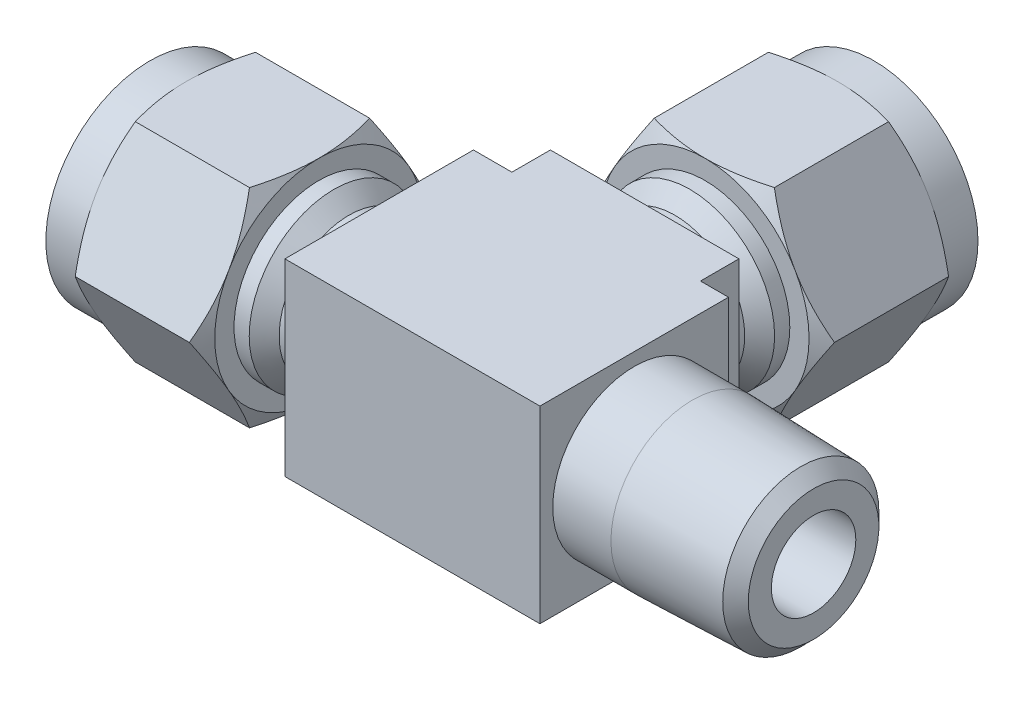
ISO-10303-21;
HEADER;
FILE_DESCRIPTION(('STEP AP214'),'2;1');
FILE_NAME('part.step','',(''),(''),'','','');
FILE_SCHEMA(('AUTOMOTIVE_DESIGN { 1 0 10303 214 1 1 1 1 }'));
ENDSEC;
DATA;
#1=APPLICATION_CONTEXT('core data for automotive mechanical design processes');
#2=APPLICATION_PROTOCOL_DEFINITION('international standard','automotive_design',2000,#1);
#3=PRODUCT_CONTEXT('',#1,'mechanical');
#4=PRODUCT('Part','Part','',(#3));
#5=PRODUCT_RELATED_PRODUCT_CATEGORY('part','',(#4));
#6=PRODUCT_DEFINITION_FORMATION('','',#4);
#7=PRODUCT_DEFINITION_CONTEXT('part definition',#1,'design');
#8=PRODUCT_DEFINITION('design','',#6,#7);
#9=PRODUCT_DEFINITION_SHAPE('','',#8);
#10=(LENGTH_UNIT() NAMED_UNIT(*) SI_UNIT(.MILLI.,.METRE.));
#11=(NAMED_UNIT(*) PLANE_ANGLE_UNIT() SI_UNIT($,.RADIAN.));
#12=(NAMED_UNIT(*) SI_UNIT($,.STERADIAN.) SOLID_ANGLE_UNIT());
#13=UNCERTAINTY_MEASURE_WITH_UNIT(LENGTH_MEASURE(1.E-05),#10,'distance_accuracy_value','');
#14=(GEOMETRIC_REPRESENTATION_CONTEXT(3) GLOBAL_UNCERTAINTY_ASSIGNED_CONTEXT((#13)) GLOBAL_UNIT_ASSIGNED_CONTEXT((#10,
#11,#12)) REPRESENTATION_CONTEXT('',''));
#15=CARTESIAN_POINT('',(0.,0.,0.));
#16=DIRECTION('',(0.,0.,1.));
#17=DIRECTION('',(1.,0.,0.));
#18=AXIS2_PLACEMENT_3D('',#15,#16,#17);
#19=CARTESIAN_POINT('',(30.48,0.,-15.61592));
#20=DIRECTION('',(0.,0.,1.));
#21=DIRECTION('',(1.,0.,0.));
#22=AXIS2_PLACEMENT_3D('',#19,#20,#21);
#23=CYLINDRICAL_SURFACE('',#22,7.14375);
#24=CARTESIAN_POINT('',(30.48,0.,-14.9758399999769));
#25=DIRECTION('',(0.,0.,-1.));
#26=DIRECTION('',(-1.,0.,0.));
#27=AXIS2_PLACEMENT_3D('',#24,#25,#26);
#28=CIRCLE('',#27,7.14375000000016);
#29=CARTESIAN_POINT('',(23.3362499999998,0.,-14.9758399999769));
#30=VERTEX_POINT('',#29);
#31=EDGE_CURVE('E526',#30,#30,#28,.F.);
#32=ORIENTED_EDGE('',*,*,#31,.F.);
#33=EDGE_LOOP('',(#32));
#34=FACE_BOUND('',#33,.T.);
#35=CARTESIAN_POINT('',(30.48,0.,-16.256));
#36=DIRECTION('',(0.,0.,1.));
#37=DIRECTION('',(1.,0.,0.));
#38=AXIS2_PLACEMENT_3D('',#35,#36,#37);
#39=CIRCLE('',#38,7.14375);
#40=CARTESIAN_POINT('',(37.62375,0.,-16.256));
#41=VERTEX_POINT('',#40);
#42=EDGE_CURVE('E19',#41,#41,#39,.F.);
#43=ORIENTED_EDGE('',*,*,#42,.F.);
#44=EDGE_LOOP('',(#43));
#45=FACE_BOUND('',#44,.T.);
#46=ADVANCED_FACE('F16',(#34,#45),#23,.T.);
#47=CARTESIAN_POINT('',(22.526625,0.,-16.256));
#48=DIRECTION('',(0.,0.,1.));
#49=DIRECTION('',(0.,-1.,0.));
#50=AXIS2_PLACEMENT_3D('',#47,#48,#49);
#51=PLANE('',#50);
#52=ORIENTED_EDGE('',*,*,#42,.T.);
#53=EDGE_LOOP('',(#52));
#54=FACE_BOUND('',#53,.T.);
#55=CARTESIAN_POINT('',(30.48,0.,-16.256));
#56=DIRECTION('',(0.,0.,-1.));
#57=DIRECTION('',(-1.,0.,0.));
#58=AXIS2_PLACEMENT_3D('',#55,#56,#57);
#59=CIRCLE('',#58,8.76300000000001);
#60=CARTESIAN_POINT('',(38.068980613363,4.3815,-16.256));
#61=VERTEX_POINT('',#60);
#62=CARTESIAN_POINT('',(30.48,8.763,-16.256));
#63=VERTEX_POINT('',#62);
#64=EDGE_CURVE('E391',#61,#63,#59,.F.);
#65=ORIENTED_EDGE('',*,*,#64,.T.);
#66=CARTESIAN_POINT('',(30.48,0.,-16.256));
#67=DIRECTION('',(0.,0.,-1.));
#68=DIRECTION('',(-1.,0.,0.));
#69=AXIS2_PLACEMENT_3D('',#66,#67,#68);
#70=CIRCLE('',#69,8.763);
#71=CARTESIAN_POINT('',(22.891019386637,4.3815,-16.256));
#72=VERTEX_POINT('',#71);
#73=EDGE_CURVE('E209',#63,#72,#70,.F.);
#74=ORIENTED_EDGE('',*,*,#73,.T.);
#75=CARTESIAN_POINT('',(30.48,0.,-16.256));
#76=DIRECTION('',(0.,0.,-1.));
#77=DIRECTION('',(-1.,0.,0.));
#78=AXIS2_PLACEMENT_3D('',#75,#76,#77);
#79=CIRCLE('',#78,8.763);
#80=CARTESIAN_POINT('',(22.891019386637,-4.38150000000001,-16.256));
#81=VERTEX_POINT('',#80);
#82=EDGE_CURVE('E195',#72,#81,#79,.F.);
#83=ORIENTED_EDGE('',*,*,#82,.T.);
#84=CARTESIAN_POINT('',(30.48,0.,-16.256));
#85=DIRECTION('',(0.,0.,-1.));
#86=DIRECTION('',(-1.,0.,0.));
#87=AXIS2_PLACEMENT_3D('',#84,#85,#86);
#88=CIRCLE('',#87,8.763);
#89=CARTESIAN_POINT('',(30.48,-8.763,-16.256));
#90=VERTEX_POINT('',#89);
#91=EDGE_CURVE('E187',#81,#90,#88,.F.);
#92=ORIENTED_EDGE('',*,*,#91,.T.);
#93=CARTESIAN_POINT('',(30.48,0.,-16.256));
#94=DIRECTION('',(0.,0.,-1.));
#95=DIRECTION('',(-1.,0.,0.));
#96=AXIS2_PLACEMENT_3D('',#93,#94,#95);
#97=CIRCLE('',#96,8.763);
#98=CARTESIAN_POINT('',(38.068980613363,-4.3815,-16.256));
#99=VERTEX_POINT('',#98);
#100=EDGE_CURVE('E386',#90,#99,#97,.F.);
#101=ORIENTED_EDGE('',*,*,#100,.T.);
#102=CARTESIAN_POINT('',(30.48,0.,-16.256));
#103=DIRECTION('',(0.,0.,-1.));
#104=DIRECTION('',(-1.,0.,0.));
#105=AXIS2_PLACEMENT_3D('',#102,#103,#104);
#106=CIRCLE('',#105,8.763);
#107=EDGE_CURVE('E388',#99,#61,#106,.F.);
#108=ORIENTED_EDGE('',*,*,#107,.T.);
#109=EDGE_LOOP('',(#65,#74,#83,#92,#101,#108));
#110=FACE_BOUND('',#109,.T.);
#111=ADVANCED_FACE('F208',(#54,#110),#51,.T.);
#112=CARTESIAN_POINT('',(14.86408,0.,0.));
#113=DIRECTION('',(1.,0.,0.));
#114=DIRECTION('',(0.,0.,-1.));
#115=AXIS2_PLACEMENT_3D('',#112,#113,#114);
#116=CYLINDRICAL_SURFACE('',#115,7.14375);
#117=CARTESIAN_POINT('',(15.5041599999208,0.,0.));
#118=DIRECTION('',(-1.,0.,0.));
#119=DIRECTION('',(0.,0.,1.));
#120=AXIS2_PLACEMENT_3D('',#117,#118,#119);
#121=CIRCLE('',#120,7.14375000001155);
#122=CARTESIAN_POINT('',(15.5041599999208,0.,7.14375000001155));
#123=VERTEX_POINT('',#122);
#124=EDGE_CURVE('E196',#123,#123,#121,.F.);
#125=ORIENTED_EDGE('',*,*,#124,.F.);
#126=EDGE_LOOP('',(#125));
#127=FACE_BOUND('',#126,.T.);
#128=CARTESIAN_POINT('',(14.224,0.,0.));
#129=DIRECTION('',(1.,0.,0.));
#130=DIRECTION('',(0.,0.,-1.));
#131=AXIS2_PLACEMENT_3D('',#128,#129,#130);
#132=CIRCLE('',#131,7.14375);
#133=CARTESIAN_POINT('',(14.224,0.,-7.14375));
#134=VERTEX_POINT('',#133);
#135=EDGE_CURVE('E382',#134,#134,#132,.F.);
#136=ORIENTED_EDGE('',*,*,#135,.F.);
#137=EDGE_LOOP('',(#136));
#138=FACE_BOUND('',#137,.T.);
#139=ADVANCED_FACE('F840',(#127,#138),#116,.T.);
#140=CARTESIAN_POINT('',(30.48,0.,-14.9758399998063));
#141=DIRECTION('',(0.,0.,-1.));
#142=DIRECTION('',(-1.,0.,0.));
#143=AXIS2_PLACEMENT_3D('',#140,#141,#142);
#144=CONICAL_SURFACE('',#143,7.14374999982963,0.785398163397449);
#145=CARTESIAN_POINT('',(30.48,0.,-13.716));
#146=DIRECTION('',(0.,0.,1.));
#147=DIRECTION('',(1.,0.,0.));
#148=AXIS2_PLACEMENT_3D('',#145,#146,#147);
#149=CIRCLE('',#148,5.88391);
#150=CARTESIAN_POINT('',(36.36391,0.,-13.716));
#151=VERTEX_POINT('',#150);
#152=EDGE_CURVE('E385',#151,#151,#149,.T.);
#153=ORIENTED_EDGE('',*,*,#152,.F.);
#154=EDGE_LOOP('',(#153));
#155=FACE_BOUND('',#154,.T.);
#156=ORIENTED_EDGE('',*,*,#31,.T.);
#157=EDGE_LOOP('',(#156));
#158=FACE_BOUND('',#157,.T.);
#159=ADVANCED_FACE('F836',(#155,#158),#144,.T.);
#160=CARTESIAN_POINT('',(15.5041600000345,0.,0.));
#161=DIRECTION('',(-1.,0.,0.));
#162=DIRECTION('',(0.,0.,1.));
#163=AXIS2_PLACEMENT_3D('',#160,#161,#162);
#164=CONICAL_SURFACE('',#163,7.14374999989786,0.785398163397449);
#165=CARTESIAN_POINT('',(16.764,0.,0.));
#166=DIRECTION('',(1.,0.,0.));
#167=DIRECTION('',(0.,0.,-1.));
#168=AXIS2_PLACEMENT_3D('',#165,#166,#167);
#169=CIRCLE('',#168,5.88391);
#170=CARTESIAN_POINT('',(16.764,0.,-5.88391));
#171=VERTEX_POINT('',#170);
#172=EDGE_CURVE('E378',#171,#171,#169,.T.);
#173=ORIENTED_EDGE('',*,*,#172,.F.);
#174=EDGE_LOOP('',(#173));
#175=FACE_BOUND('',#174,.T.);
#176=ORIENTED_EDGE('',*,*,#124,.T.);
#177=EDGE_LOOP('',(#176));
#178=FACE_BOUND('',#177,.T.);
#179=ADVANCED_FACE('F833',(#175,#178),#164,.T.);
#180=CARTESIAN_POINT('',(30.48,0.,-16.256));
#181=DIRECTION('',(0.,0.,-1.));
#182=DIRECTION('',(-1.,0.,0.));
#183=AXIS2_PLACEMENT_3D('',#180,#181,#182);
#184=CONICAL_SURFACE('',#183,8.763,1.0471975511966);
#185=ORIENTED_EDGE('',*,*,#91,.F.);
#186=CARTESIAN_POINT('',(25.4206795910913,-8.763,-17.0386795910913));
#187=CARTESIAN_POINT('',(25.2147663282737,-8.40634776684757,-16.9197656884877));
#188=CARTESIAN_POINT('',(25.0072040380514,-8.04683933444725,-16.8108197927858));
#189=CARTESIAN_POINT('',(24.5902498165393,-7.32465343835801,-16.6186956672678));
#190=CARTESIAN_POINT('',(24.3808724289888,-6.96200116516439,-16.5353900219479));
#191=CARTESIAN_POINT('',(24.0648303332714,-6.4146001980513,-16.4331048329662));
#192=CARTESIAN_POINT('',(23.9590837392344,-6.23144172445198,-16.4027762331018));
#193=CARTESIAN_POINT('',(23.7470842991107,-5.86424792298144,-16.3502767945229));
#194=CARTESIAN_POINT('',(23.640831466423,-5.68021261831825,-16.3281057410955));
#195=CARTESIAN_POINT('',(23.4274265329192,-5.31058443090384,-16.2923109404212));
#196=CARTESIAN_POINT('',(23.3202725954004,-5.12498836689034,-16.278730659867));
#197=CARTESIAN_POINT('',(23.1057539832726,-4.75343123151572,-16.2605563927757));
#198=CARTESIAN_POINT('',(22.9983892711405,-4.56747009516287,-16.2559641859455));
#199=CARTESIAN_POINT('',(22.891019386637,-4.38150000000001,-16.256));
#200=B_SPLINE_CURVE_WITH_KNOTS('',3,(#186,#187,#188,#189,#190,#191,#192,#193,#194,#195,#196,
#197,#198,#199),.UNSPECIFIED.,.F.,.F.,(4,2,2,2,2,2,4),(0.,1.28647264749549,2.56644510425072,
3.20727112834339,3.84808028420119,4.49210633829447,5.13625990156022),.UNSPECIFIED.);
#201=CARTESIAN_POINT('',(25.4206795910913,-8.763,-17.0386795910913));
#202=VERTEX_POINT('',#201);
#203=EDGE_CURVE('E190',#202,#81,#200,.T.);
#204=ORIENTED_EDGE('',*,*,#203,.F.);
#205=CARTESIAN_POINT('',(30.48,-8.763,-16.256));
#206=CARTESIAN_POINT('',(30.265260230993,-8.763,-16.2559641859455));
#207=CARTESIAN_POINT('',(30.0505308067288,-8.763,-16.2605563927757));
#208=CARTESIAN_POINT('',(29.621493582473,-8.763,-16.278730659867));
#209=CARTESIAN_POINT('',(29.4071857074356,-8.763,-16.2923109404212));
#210=CARTESIAN_POINT('',(28.980375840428,-8.763,-16.3281057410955));
#211=CARTESIAN_POINT('',(28.7678701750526,-8.763,-16.3502767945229));
#212=CARTESIAN_POINT('',(28.3438712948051,-8.763,-16.4027762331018));
#213=CARTESIAN_POINT('',(28.1323781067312,-8.763,-16.4331048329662));
#214=CARTESIAN_POINT('',(27.5002939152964,-8.763,-16.5353900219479));
#215=CARTESIAN_POINT('',(27.0815391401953,-8.763,-16.6186956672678));
#216=CARTESIAN_POINT('',(26.2476306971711,-8.763,-16.8108197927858));
#217=CARTESIAN_POINT('',(25.8325061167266,-8.763,-16.9197656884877));
#218=CARTESIAN_POINT('',(25.4206795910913,-8.763,-17.0386795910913));
#219=B_SPLINE_CURVE_WITH_KNOTS('',3,(#205,#206,#207,#208,#209,#210,#211,#212,#213,#214,#215,
#216,#217,#218),.UNSPECIFIED.,.F.,.F.,(4,2,2,2,2,2,4),(0.,0.644153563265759,1.28817961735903,
1.92898877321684,2.56981479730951,3.84978725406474,5.13625990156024),.UNSPECIFIED.);
#220=EDGE_CURVE('E191',#90,#202,#219,.T.);
#221=ORIENTED_EDGE('',*,*,#220,.F.);
#222=EDGE_LOOP('',(#185,#204,#221));
#223=FACE_BOUND('',#222,.T.);
#224=ADVANCED_FACE('F189',(#223),#184,.T.);
#225=CARTESIAN_POINT('',(30.48,0.,-16.256));
#226=DIRECTION('',(0.,0.,-1.));
#227=DIRECTION('',(-1.,0.,0.));
#228=AXIS2_PLACEMENT_3D('',#225,#226,#227);
#229=CONICAL_SURFACE('',#228,8.763,1.0471975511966);
#230=ORIENTED_EDGE('',*,*,#82,.F.);
#231=CARTESIAN_POINT('',(20.3613591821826,0.,-17.0386795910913));
#232=CARTESIAN_POINT('',(20.5672724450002,0.356652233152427,-16.9197656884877));
#233=CARTESIAN_POINT('',(20.7748347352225,0.716160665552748,-16.8108197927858));
#234=CARTESIAN_POINT('',(21.1917889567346,1.438346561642,-16.6186956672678));
#235=CARTESIAN_POINT('',(21.4011663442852,1.80099883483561,-16.5353900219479));
#236=CARTESIAN_POINT('',(21.7172084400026,2.3483998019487,-16.4331048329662));
#237=CARTESIAN_POINT('',(21.8229550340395,2.53155827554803,-16.4027762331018));
#238=CARTESIAN_POINT('',(22.0349544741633,2.89875207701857,-16.3502767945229));
#239=CARTESIAN_POINT('',(22.141207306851,3.08278738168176,-16.3281057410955));
#240=CARTESIAN_POINT('',(22.3546122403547,3.45241556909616,-16.2923109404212));
#241=CARTESIAN_POINT('',(22.4617661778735,3.63801163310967,-16.278730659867));
#242=CARTESIAN_POINT('',(22.6762847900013,4.00956876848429,-16.2605563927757));
#243=CARTESIAN_POINT('',(22.7836495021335,4.19552990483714,-16.2559641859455));
#244=CARTESIAN_POINT('',(22.891019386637,4.3815,-16.256));
#245=B_SPLINE_CURVE_WITH_KNOTS('',3,(#231,#232,#233,#234,#235,#236,#237,#238,#239,#240,#241,
#242,#243,#244),.UNSPECIFIED.,.F.,.F.,(4,2,2,2,2,2,4),(0.,1.2864726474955,2.56644510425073,
3.2072711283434,3.8480802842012,4.49210633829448,5.13625990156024),.UNSPECIFIED.);
#246=CARTESIAN_POINT('',(20.3613591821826,0.,-17.0386795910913));
#247=VERTEX_POINT('',#246);
#248=EDGE_CURVE('E216',#247,#72,#245,.T.);
#249=ORIENTED_EDGE('',*,*,#248,.F.);
#250=CARTESIAN_POINT('',(22.891019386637,-4.38150000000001,-16.256));
#251=CARTESIAN_POINT('',(22.7836495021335,-4.19552990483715,-16.2559641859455));
#252=CARTESIAN_POINT('',(22.6762847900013,-4.0095687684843,-16.2605563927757));
#253=CARTESIAN_POINT('',(22.4617661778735,-3.63801163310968,-16.278730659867));
#254=CARTESIAN_POINT('',(22.3546122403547,-3.45241556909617,-16.2923109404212));
#255=CARTESIAN_POINT('',(22.141207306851,-3.08278738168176,-16.3281057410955));
#256=CARTESIAN_POINT('',(22.0349544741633,-2.89875207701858,-16.3502767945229));
#257=CARTESIAN_POINT('',(21.8229550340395,-2.53155827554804,-16.4027762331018));
#258=CARTESIAN_POINT('',(21.7172084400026,-2.34839980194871,-16.4331048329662));
#259=CARTESIAN_POINT('',(21.4011663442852,-1.80099883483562,-16.5353900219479));
#260=CARTESIAN_POINT('',(21.1917889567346,-1.438346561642,-16.6186956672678));
#261=CARTESIAN_POINT('',(20.7748347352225,-0.716160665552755,-16.8108197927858));
#262=CARTESIAN_POINT('',(20.5672724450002,-0.356652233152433,-16.9197656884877));
#263=CARTESIAN_POINT('',(20.3613591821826,0.,-17.0386795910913));
#264=B_SPLINE_CURVE_WITH_KNOTS('',3,(#250,#251,#252,#253,#254,#255,#256,#257,#258,#259,#260,
#261,#262,#263),.UNSPECIFIED.,.F.,.F.,(4,2,2,2,2,2,4),(0.,0.644153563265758,1.28817961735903,
1.92898877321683,2.56981479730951,3.84978725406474,5.13625990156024),.UNSPECIFIED.);
#265=EDGE_CURVE('E201',#81,#247,#264,.T.);
#266=ORIENTED_EDGE('',*,*,#265,.F.);
#267=EDGE_LOOP('',(#230,#249,#266));
#268=FACE_BOUND('',#267,.T.);
#269=ADVANCED_FACE('F215',(#268),#229,.T.);
#270=CARTESIAN_POINT('',(30.48,0.,-16.256));
#271=DIRECTION('',(0.,0.,-1.));
#272=DIRECTION('',(-1.,0.,0.));
#273=AXIS2_PLACEMENT_3D('',#270,#271,#272);
#274=CONICAL_SURFACE('',#273,8.763,1.0471975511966);
#275=CARTESIAN_POINT('',(22.891019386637,4.3815,-16.256));
#276=CARTESIAN_POINT('',(22.9983892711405,4.56747009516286,-16.2559641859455));
#277=CARTESIAN_POINT('',(23.1057539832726,4.75343123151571,-16.2605563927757));
#278=CARTESIAN_POINT('',(23.3202725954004,5.12498836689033,-16.278730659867));
#279=CARTESIAN_POINT('',(23.4274265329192,5.31058443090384,-16.2923109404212));
#280=CARTESIAN_POINT('',(23.640831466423,5.68021261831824,-16.3281057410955));
#281=CARTESIAN_POINT('',(23.7470842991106,5.86424792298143,-16.3502767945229));
#282=CARTESIAN_POINT('',(23.9590837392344,6.23144172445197,-16.4027762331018));
#283=CARTESIAN_POINT('',(24.0648303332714,6.4146001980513,-16.4331048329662));
#284=CARTESIAN_POINT('',(24.3808724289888,6.96200116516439,-16.5353900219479));
#285=CARTESIAN_POINT('',(24.5902498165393,7.324653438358,-16.6186956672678));
#286=CARTESIAN_POINT('',(25.0072040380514,8.04683933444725,-16.8108197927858));
#287=CARTESIAN_POINT('',(25.2147663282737,8.40634776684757,-16.9197656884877));
#288=CARTESIAN_POINT('',(25.4206795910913,8.763,-17.0386795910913));
#289=B_SPLINE_CURVE_WITH_KNOTS('',3,(#275,#276,#277,#278,#279,#280,#281,#282,#283,#284,#285,
#286,#287,#288),.UNSPECIFIED.,.F.,.F.,(4,2,2,2,2,2,4),(0.,0.644153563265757,1.28817961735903,
1.92898877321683,2.5698147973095,3.84978725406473,5.13625990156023),.UNSPECIFIED.);
#290=CARTESIAN_POINT('',(25.4206795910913,8.763,-17.0386795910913));
#291=VERTEX_POINT('',#290);
#292=EDGE_CURVE('E517',#72,#291,#289,.T.);
#293=ORIENTED_EDGE('',*,*,#292,.F.);
#294=ORIENTED_EDGE('',*,*,#73,.F.);
#295=CARTESIAN_POINT('',(25.4206795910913,8.763,-17.0386795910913));
#296=CARTESIAN_POINT('',(25.8325061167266,8.763,-16.9197656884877));
#297=CARTESIAN_POINT('',(26.2476306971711,8.763,-16.8108197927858));
#298=CARTESIAN_POINT('',(27.0815391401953,8.763,-16.6186956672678));
#299=CARTESIAN_POINT('',(27.5002939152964,8.763,-16.5353900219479));
#300=CARTESIAN_POINT('',(28.1323781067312,8.763,-16.4331048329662));
#301=CARTESIAN_POINT('',(28.3438712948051,8.763,-16.4027762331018));
#302=CARTESIAN_POINT('',(28.7678701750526,8.763,-16.3502767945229));
#303=CARTESIAN_POINT('',(28.980375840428,8.763,-16.3281057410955));
#304=CARTESIAN_POINT('',(29.4071857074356,8.763,-16.2923109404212));
#305=CARTESIAN_POINT('',(29.621493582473,8.763,-16.278730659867));
#306=CARTESIAN_POINT('',(30.0505308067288,8.763,-16.2605563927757));
#307=CARTESIAN_POINT('',(30.265260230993,8.763,-16.2559641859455));
#308=CARTESIAN_POINT('',(30.48,8.763,-16.256));
#309=B_SPLINE_CURVE_WITH_KNOTS('',3,(#295,#296,#297,#298,#299,#300,#301,#302,#303,#304,#305,
#306,#307,#308),.UNSPECIFIED.,.F.,.F.,(4,2,2,2,2,2,4),(0.,1.2864726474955,2.56644510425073,
3.20727112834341,3.8480802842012,4.49210633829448,5.13625990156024),.UNSPECIFIED.);
#310=EDGE_CURVE('E406',#291,#63,#309,.T.);
#311=ORIENTED_EDGE('',*,*,#310,.F.);
#312=EDGE_LOOP('',(#293,#294,#311));
#313=FACE_BOUND('',#312,.T.);
#314=ADVANCED_FACE('F1117',(#313),#274,.T.);
#315=CARTESIAN_POINT('',(30.48,0.,-16.256));
#316=DIRECTION('',(0.,0.,-1.));
#317=DIRECTION('',(-1.,0.,0.));
#318=AXIS2_PLACEMENT_3D('',#315,#316,#317);
#319=CONICAL_SURFACE('',#318,8.763,1.0471975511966);
#320=CARTESIAN_POINT('',(30.48,8.763,-16.256));
#321=CARTESIAN_POINT('',(30.694739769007,8.763,-16.2559641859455));
#322=CARTESIAN_POINT('',(30.9094691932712,8.763,-16.2605563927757));
#323=CARTESIAN_POINT('',(31.338506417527,8.763,-16.278730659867));
#324=CARTESIAN_POINT('',(31.5528142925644,8.763,-16.2923109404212));
#325=CARTESIAN_POINT('',(31.979624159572,8.763,-16.3281057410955));
#326=CARTESIAN_POINT('',(32.1921298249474,8.763,-16.3502767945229));
#327=CARTESIAN_POINT('',(32.6161287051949,8.763,-16.4027762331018));
#328=CARTESIAN_POINT('',(32.8276218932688,8.763,-16.4331048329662));
#329=CARTESIAN_POINT('',(33.4597060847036,8.763,-16.5353900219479));
#330=CARTESIAN_POINT('',(33.8784608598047,8.763,-16.6186956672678));
#331=CARTESIAN_POINT('',(34.7123693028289,8.763,-16.8108197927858));
#332=CARTESIAN_POINT('',(35.1274938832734,8.763,-16.9197656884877));
#333=CARTESIAN_POINT('',(35.5393204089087,8.763,-17.0386795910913));
#334=B_SPLINE_CURVE_WITH_KNOTS('',3,(#320,#321,#322,#323,#324,#325,#326,#327,#328,#329,#330,
#331,#332,#333),.UNSPECIFIED.,.F.,.F.,(4,2,2,2,2,2,4),(0.,0.644153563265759,1.28817961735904,
1.92898877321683,2.56981479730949,3.84978725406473,5.13625990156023),.UNSPECIFIED.);
#335=CARTESIAN_POINT('',(35.5393204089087,8.763,-17.0386795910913));
#336=VERTEX_POINT('',#335);
#337=EDGE_CURVE('E398',#63,#336,#334,.T.);
#338=ORIENTED_EDGE('',*,*,#337,.F.);
#339=ORIENTED_EDGE('',*,*,#64,.F.);
#340=CARTESIAN_POINT('',(35.5393204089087,8.76300000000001,-17.0386795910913));
#341=CARTESIAN_POINT('',(35.7452336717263,8.40634776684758,-16.9197656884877));
#342=CARTESIAN_POINT('',(35.9527959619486,8.04683933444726,-16.8108197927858));
#343=CARTESIAN_POINT('',(36.3697501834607,7.32465343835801,-16.6186956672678));
#344=CARTESIAN_POINT('',(36.5791275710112,6.96200116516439,-16.5353900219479));
#345=CARTESIAN_POINT('',(36.8951696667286,6.4146001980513,-16.4331048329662));
#346=CARTESIAN_POINT('',(37.0009162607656,6.23144172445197,-16.4027762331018));
#347=CARTESIAN_POINT('',(37.2129157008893,5.86424792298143,-16.3502767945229));
#348=CARTESIAN_POINT('',(37.319168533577,5.68021261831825,-16.3281057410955));
#349=CARTESIAN_POINT('',(37.5325734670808,5.31058443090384,-16.2923109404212));
#350=CARTESIAN_POINT('',(37.6397274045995,5.12498836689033,-16.278730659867));
#351=CARTESIAN_POINT('',(37.8542460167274,4.75343123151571,-16.2605563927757));
#352=CARTESIAN_POINT('',(37.9616107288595,4.56747009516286,-16.2559641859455));
#353=CARTESIAN_POINT('',(38.068980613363,4.3815,-16.256));
#354=B_SPLINE_CURVE_WITH_KNOTS('',3,(#340,#341,#342,#343,#344,#345,#346,#347,#348,#349,#350,
#351,#352,#353),.UNSPECIFIED.,.F.,.F.,(4,2,2,2,2,2,4),(0.,1.2864726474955,2.56644510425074,
3.20727112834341,3.84808028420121,4.49210633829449,5.13625990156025),.UNSPECIFIED.);
#355=EDGE_CURVE('E400',#336,#61,#354,.T.);
#356=ORIENTED_EDGE('',*,*,#355,.F.);
#357=EDGE_LOOP('',(#338,#339,#356));
#358=FACE_BOUND('',#357,.T.);
#359=ADVANCED_FACE('F399',(#358),#319,.T.);
#360=CARTESIAN_POINT('',(30.48,0.,-16.256));
#361=DIRECTION('',(0.,0.,-1.));
#362=DIRECTION('',(-1.,0.,0.));
#363=AXIS2_PLACEMENT_3D('',#360,#361,#362);
#364=CONICAL_SURFACE('',#363,8.76299999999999,1.0471975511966);
#365=CARTESIAN_POINT('',(38.068980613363,4.3815,-16.256));
#366=CARTESIAN_POINT('',(38.1763504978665,4.19552990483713,-16.2559641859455));
#367=CARTESIAN_POINT('',(38.2837152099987,4.00956876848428,-16.2605563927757));
#368=CARTESIAN_POINT('',(38.4982338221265,3.63801163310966,-16.278730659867));
#369=CARTESIAN_POINT('',(38.6053877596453,3.45241556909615,-16.2923109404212));
#370=CARTESIAN_POINT('',(38.818792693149,3.08278738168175,-16.3281057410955));
#371=CARTESIAN_POINT('',(38.9250455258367,2.89875207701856,-16.3502767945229));
#372=CARTESIAN_POINT('',(39.1370449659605,2.53155827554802,-16.4027762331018));
#373=CARTESIAN_POINT('',(39.2427915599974,2.3483998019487,-16.4331048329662));
#374=CARTESIAN_POINT('',(39.5588336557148,1.8009988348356,-16.5353900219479));
#375=CARTESIAN_POINT('',(39.7682110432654,1.43834656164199,-16.6186956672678));
#376=CARTESIAN_POINT('',(40.1851652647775,0.716160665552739,-16.8108197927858));
#377=CARTESIAN_POINT('',(40.3927275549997,0.356652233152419,-16.9197656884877));
#378=CARTESIAN_POINT('',(40.5986408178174,0.,-17.0386795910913));
#379=B_SPLINE_CURVE_WITH_KNOTS('',3,(#365,#366,#367,#368,#369,#370,#371,#372,#373,#374,#375,
#376,#377,#378),.UNSPECIFIED.,.F.,.F.,(4,2,2,2,2,2,4),(0.,0.644153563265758,1.28817961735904,
1.92898877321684,2.56981479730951,3.84978725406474,5.13625990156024),.UNSPECIFIED.);
#380=CARTESIAN_POINT('',(40.5986408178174,0.,-17.0386795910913));
#381=VERTEX_POINT('',#380);
#382=EDGE_CURVE('E514',#61,#381,#379,.T.);
#383=ORIENTED_EDGE('',*,*,#382,.F.);
#384=ORIENTED_EDGE('',*,*,#107,.F.);
#385=CARTESIAN_POINT('',(40.5986408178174,0.,-17.0386795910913));
#386=CARTESIAN_POINT('',(40.3927275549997,-0.356652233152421,-16.9197656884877));
#387=CARTESIAN_POINT('',(40.1851652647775,-0.716160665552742,-16.8108197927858));
#388=CARTESIAN_POINT('',(39.7682110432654,-1.43834656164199,-16.6186956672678));
#389=CARTESIAN_POINT('',(39.5588336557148,-1.80099883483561,-16.5353900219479));
#390=CARTESIAN_POINT('',(39.2427915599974,-2.3483998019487,-16.4331048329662));
#391=CARTESIAN_POINT('',(39.1370449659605,-2.53155827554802,-16.4027762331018));
#392=CARTESIAN_POINT('',(38.9250455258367,-2.89875207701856,-16.3502767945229));
#393=CARTESIAN_POINT('',(38.818792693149,-3.08278738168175,-16.3281057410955));
#394=CARTESIAN_POINT('',(38.6053877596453,-3.45241556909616,-16.2923109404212));
#395=CARTESIAN_POINT('',(38.4982338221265,-3.63801163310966,-16.278730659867));
#396=CARTESIAN_POINT('',(38.2837152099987,-4.00956876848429,-16.2605563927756));
#397=CARTESIAN_POINT('',(38.1763504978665,-4.19552990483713,-16.2559641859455));
#398=CARTESIAN_POINT('',(38.068980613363,-4.3815,-16.256));
#399=B_SPLINE_CURVE_WITH_KNOTS('',3,(#385,#386,#387,#388,#389,#390,#391,#392,#393,#394,#395,
#396,#397,#398),.UNSPECIFIED.,.F.,.F.,(4,2,2,2,2,2,4),(0.,1.2864726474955,2.56644510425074,
3.2072711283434,3.84808028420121,4.49210633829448,5.13625990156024),.UNSPECIFIED.);
#400=EDGE_CURVE('E352',#381,#99,#399,.T.);
#401=ORIENTED_EDGE('',*,*,#400,.F.);
#402=EDGE_LOOP('',(#383,#384,#401));
#403=FACE_BOUND('',#402,.T.);
#404=ADVANCED_FACE('F365',(#403),#364,.T.);
#405=CARTESIAN_POINT('',(30.48,0.,-16.256));
#406=DIRECTION('',(0.,0.,-1.));
#407=DIRECTION('',(-1.,0.,0.));
#408=AXIS2_PLACEMENT_3D('',#405,#406,#407);
#409=CONICAL_SURFACE('',#408,8.76299999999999,1.0471975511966);
#410=ORIENTED_EDGE('',*,*,#100,.F.);
#411=CARTESIAN_POINT('',(35.5393204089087,-8.76299999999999,-17.0386795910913));
#412=CARTESIAN_POINT('',(35.1274938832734,-8.76299999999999,-16.9197656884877));
#413=CARTESIAN_POINT('',(34.7123693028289,-8.76299999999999,-16.8108197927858));
#414=CARTESIAN_POINT('',(33.8784608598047,-8.76299999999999,-16.6186956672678));
#415=CARTESIAN_POINT('',(33.4597060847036,-8.76299999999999,-16.5353900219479));
#416=CARTESIAN_POINT('',(32.8276218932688,-8.76299999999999,-16.4331048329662));
#417=CARTESIAN_POINT('',(32.6161287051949,-8.76299999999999,-16.4027762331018));
#418=CARTESIAN_POINT('',(32.1921298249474,-8.76299999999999,-16.3502767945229));
#419=CARTESIAN_POINT('',(31.979624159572,-8.76299999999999,-16.3281057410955));
#420=CARTESIAN_POINT('',(31.5528142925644,-8.76299999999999,-16.2923109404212));
#421=CARTESIAN_POINT('',(31.338506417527,-8.763,-16.278730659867));
#422=CARTESIAN_POINT('',(30.9094691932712,-8.763,-16.2605563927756));
#423=CARTESIAN_POINT('',(30.694739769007,-8.763,-16.2559641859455));
#424=CARTESIAN_POINT('',(30.48,-8.763,-16.256));
#425=B_SPLINE_CURVE_WITH_KNOTS('',3,(#411,#412,#413,#414,#415,#416,#417,#418,#419,#420,#421,
#422,#423,#424),.UNSPECIFIED.,.F.,.F.,(4,2,2,2,2,2,4),(0.,1.2864726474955,2.56644510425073,
3.20727112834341,3.84808028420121,4.49210633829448,5.13625990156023),.UNSPECIFIED.);
#426=CARTESIAN_POINT('',(35.5393204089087,-8.763,-17.0386795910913));
#427=VERTEX_POINT('',#426);
#428=EDGE_CURVE('E372',#427,#90,#425,.T.);
#429=ORIENTED_EDGE('',*,*,#428,.F.);
#430=CARTESIAN_POINT('',(38.068980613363,-4.3815,-16.256));
#431=CARTESIAN_POINT('',(37.9616107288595,-4.56747009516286,-16.2559641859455));
#432=CARTESIAN_POINT('',(37.8542460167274,-4.75343123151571,-16.2605563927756));
#433=CARTESIAN_POINT('',(37.6397274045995,-5.12498836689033,-16.278730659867));
#434=CARTESIAN_POINT('',(37.5325734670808,-5.31058443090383,-16.2923109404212));
#435=CARTESIAN_POINT('',(37.319168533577,-5.68021261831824,-16.3281057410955));
#436=CARTESIAN_POINT('',(37.2129157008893,-5.86424792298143,-16.3502767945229));
#437=CARTESIAN_POINT('',(37.0009162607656,-6.23144172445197,-16.4027762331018));
#438=CARTESIAN_POINT('',(36.8951696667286,-6.41460019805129,-16.4331048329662));
#439=CARTESIAN_POINT('',(36.5791275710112,-6.96200116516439,-16.5353900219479));
#440=CARTESIAN_POINT('',(36.3697501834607,-7.324653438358,-16.6186956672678));
#441=CARTESIAN_POINT('',(35.9527959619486,-8.04683933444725,-16.8108197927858));
#442=CARTESIAN_POINT('',(35.7452336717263,-8.40634776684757,-16.9197656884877));
#443=CARTESIAN_POINT('',(35.5393204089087,-8.763,-17.0386795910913));
#444=B_SPLINE_CURVE_WITH_KNOTS('',3,(#430,#431,#432,#433,#434,#435,#436,#437,#438,#439,#440,
#441,#442,#443),.UNSPECIFIED.,.F.,.F.,(4,2,2,2,2,2,4),(0.,0.644153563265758,1.28817961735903,
1.92898877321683,2.5698147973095,3.84978725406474,5.13625990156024),.UNSPECIFIED.);
#445=EDGE_CURVE('E345',#99,#427,#444,.T.);
#446=ORIENTED_EDGE('',*,*,#445,.F.);
#447=EDGE_LOOP('',(#410,#429,#446));
#448=FACE_BOUND('',#447,.T.);
#449=ADVANCED_FACE('F360',(#448),#409,.T.);
#450=CARTESIAN_POINT('',(14.224,0.,7.953375));
#451=DIRECTION('',(1.,0.,0.));
#452=DIRECTION('',(0.,1.,0.));
#453=AXIS2_PLACEMENT_3D('',#450,#451,#452);
#454=PLANE('',#453);
#455=ORIENTED_EDGE('',*,*,#135,.T.);
#456=EDGE_LOOP('',(#455));
#457=FACE_BOUND('',#456,.T.);
#458=CARTESIAN_POINT('',(14.224,0.,0.));
#459=DIRECTION('',(-1.,0.,0.));
#460=DIRECTION('',(0.,0.,1.));
#461=AXIS2_PLACEMENT_3D('',#458,#459,#460);
#462=CIRCLE('',#461,8.763);
#463=CARTESIAN_POINT('',(14.224,4.3815,-7.58898061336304));
#464=VERTEX_POINT('',#463);
#465=CARTESIAN_POINT('',(14.224,8.763,0.));
#466=VERTEX_POINT('',#465);
#467=EDGE_CURVE('E811',#464,#466,#462,.F.);
#468=ORIENTED_EDGE('',*,*,#467,.T.);
#469=CARTESIAN_POINT('',(14.224,0.,0.));
#470=DIRECTION('',(-1.,0.,0.));
#471=DIRECTION('',(0.,0.,1.));
#472=AXIS2_PLACEMENT_3D('',#469,#470,#471);
#473=CIRCLE('',#472,8.763);
#474=CARTESIAN_POINT('',(14.224,4.3815,7.58898061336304));
#475=VERTEX_POINT('',#474);
#476=EDGE_CURVE('E808',#466,#475,#473,.F.);
#477=ORIENTED_EDGE('',*,*,#476,.T.);
#478=CARTESIAN_POINT('',(14.224,0.,0.));
#479=DIRECTION('',(-1.,0.,0.));
#480=DIRECTION('',(0.,0.,1.));
#481=AXIS2_PLACEMENT_3D('',#478,#479,#480);
#482=CIRCLE('',#481,8.763);
#483=CARTESIAN_POINT('',(14.224,-4.38150000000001,7.58898061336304));
#484=VERTEX_POINT('',#483);
#485=EDGE_CURVE('E807',#475,#484,#482,.F.);
#486=ORIENTED_EDGE('',*,*,#485,.T.);
#487=CARTESIAN_POINT('',(14.224,0.,0.));
#488=DIRECTION('',(-1.,0.,0.));
#489=DIRECTION('',(0.,0.,1.));
#490=AXIS2_PLACEMENT_3D('',#487,#488,#489);
#491=CIRCLE('',#490,8.763);
#492=CARTESIAN_POINT('',(14.224,-8.76299999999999,0.));
#493=VERTEX_POINT('',#492);
#494=EDGE_CURVE('E353',#484,#493,#491,.F.);
#495=ORIENTED_EDGE('',*,*,#494,.T.);
#496=CARTESIAN_POINT('',(14.224,0.,0.));
#497=DIRECTION('',(-1.,0.,0.));
#498=DIRECTION('',(0.,0.,1.));
#499=AXIS2_PLACEMENT_3D('',#496,#497,#498);
#500=CIRCLE('',#499,8.763);
#501=CARTESIAN_POINT('',(14.224,-4.3815,-7.58898061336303));
#502=VERTEX_POINT('',#501);
#503=EDGE_CURVE('E510',#493,#502,#500,.F.);
#504=ORIENTED_EDGE('',*,*,#503,.T.);
#505=CARTESIAN_POINT('',(14.224,0.,0.));
#506=DIRECTION('',(-1.,0.,0.));
#507=DIRECTION('',(0.,0.,1.));
#508=AXIS2_PLACEMENT_3D('',#505,#506,#507);
#509=CIRCLE('',#508,8.763);
#510=EDGE_CURVE('E816',#502,#464,#509,.F.);
#511=ORIENTED_EDGE('',*,*,#510,.T.);
#512=EDGE_LOOP('',(#468,#477,#486,#495,#504,#511));
#513=FACE_BOUND('',#512,.T.);
#514=ADVANCED_FACE('F364',(#457,#513),#454,.T.);
#515=CARTESIAN_POINT('',(30.48,0.,-12.446));
#516=DIRECTION('',(0.,0.,1.));
#517=DIRECTION('',(1.,0.,0.));
#518=AXIS2_PLACEMENT_3D('',#515,#516,#517);
#519=CYLINDRICAL_SURFACE('',#518,5.88391);
#520=CARTESIAN_POINT('',(30.48,0.,-11.176));
#521=DIRECTION('',(0.,0.,1.));
#522=DIRECTION('',(1.,0.,0.));
#523=AXIS2_PLACEMENT_3D('',#520,#521,#522);
#524=CIRCLE('',#523,5.88391);
#525=CARTESIAN_POINT('',(36.36391,0.,-11.176));
#526=VERTEX_POINT('',#525);
#527=EDGE_CURVE('E509',#526,#526,#524,.T.);
#528=ORIENTED_EDGE('',*,*,#527,.F.);
#529=EDGE_LOOP('',(#528));
#530=FACE_BOUND('',#529,.T.);
#531=ORIENTED_EDGE('',*,*,#152,.T.);
#532=EDGE_LOOP('',(#531));
#533=FACE_BOUND('',#532,.T.);
#534=ADVANCED_FACE('F830',(#530,#533),#519,.T.);
#535=CARTESIAN_POINT('',(18.034,0.,0.));
#536=DIRECTION('',(1.,0.,0.));
#537=DIRECTION('',(0.,0.,-1.));
#538=AXIS2_PLACEMENT_3D('',#535,#536,#537);
#539=CYLINDRICAL_SURFACE('',#538,5.88391);
#540=CARTESIAN_POINT('',(19.304,0.,0.));
#541=DIRECTION('',(1.,0.,0.));
#542=DIRECTION('',(0.,0.,-1.));
#543=AXIS2_PLACEMENT_3D('',#540,#541,#542);
#544=CIRCLE('',#543,5.88391);
#545=CARTESIAN_POINT('',(19.304,0.,-5.88391));
#546=VERTEX_POINT('',#545);
#547=EDGE_CURVE('E319',#546,#546,#544,.T.);
#548=ORIENTED_EDGE('',*,*,#547,.F.);
#549=EDGE_LOOP('',(#548));
#550=FACE_BOUND('',#549,.T.);
#551=ORIENTED_EDGE('',*,*,#172,.T.);
#552=EDGE_LOOP('',(#551));
#553=FACE_BOUND('',#552,.T.);
#554=ADVANCED_FACE('F827',(#550,#553),#539,.T.);
#555=CARTESIAN_POINT('',(25.4206795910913,-8.763,-16.256));
#556=DIRECTION('',(0.,-1.,0.));
#557=DIRECTION('',(1.,0.,0.));
#558=AXIS2_PLACEMENT_3D('',#555,#556,#557);
#559=PLANE('',#558);
#560=DIRECTION('',(0.,0.,1.));
#561=VECTOR('',#560,1.);
#562=CARTESIAN_POINT('',(25.4206795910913,-8.763,-16.256));
#563=LINE('',#562,#561);
#564=CARTESIAN_POINT('',(25.4206795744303,-8.763,-26.6493204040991));
#565=VERTEX_POINT('',#564);
#566=EDGE_CURVE('E204',#565,#202,#563,.T.);
#567=ORIENTED_EDGE('',*,*,#566,.F.);
#568=CARTESIAN_POINT('',(25.4206795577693,-8.763,-26.6493203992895));
#569=CARTESIAN_POINT('',(25.8325060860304,-8.763,-26.7682343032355));
#570=CARTESIAN_POINT('',(26.2476306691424,-8.763,-26.8771802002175));
#571=CARTESIAN_POINT('',(27.0815391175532,-8.763,-27.0693043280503));
#572=CARTESIAN_POINT('',(27.5002938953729,-8.763,-27.1526099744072));
#573=CARTESIAN_POINT('',(28.1323780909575,-8.763,-27.2548951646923));
#574=CARTESIAN_POINT('',(28.3438712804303,-8.763,-27.2852237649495));
#575=CARTESIAN_POINT('',(28.7678701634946,-8.763,-27.3377232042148));
#576=CARTESIAN_POINT('',(28.9803758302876,-8.763,-27.3598942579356));
#577=CARTESIAN_POINT('',(29.407185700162,-8.763,-27.3956890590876));
#578=CARTESIAN_POINT('',(29.6214935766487,-8.763,-27.409269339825));
#579=CARTESIAN_POINT('',(30.0505308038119,-8.763,-27.4274436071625));
#580=CARTESIAN_POINT('',(30.2652602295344,-8.763,-27.4320358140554));
#581=CARTESIAN_POINT('',(30.48,-8.763,-27.432));
#582=B_SPLINE_CURVE_WITH_KNOTS('',3,(#568,#569,#570,#571,#572,#573,#574,#575,#576,#577,#578,
#579,#580,#581),.UNSPECIFIED.,.F.,.F.,(4,2,2,2,2,2,4),(0.,1.28647265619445,2.5664451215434,
3.20727114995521,3.84808031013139,4.49210636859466,5.13625993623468),.UNSPECIFIED.);
#583=CARTESIAN_POINT('',(30.48,-8.763,-27.432));
#584=VERTEX_POINT('',#583);
#585=EDGE_CURVE('E294',#565,#584,#582,.T.);
#586=ORIENTED_EDGE('',*,*,#585,.T.);
#587=CARTESIAN_POINT('',(30.48,-8.763,-27.432));
#588=CARTESIAN_POINT('',(30.6947397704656,-8.763,-27.4320358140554));
#589=CARTESIAN_POINT('',(30.9094691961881,-8.763,-27.4274436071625));
#590=CARTESIAN_POINT('',(31.3385064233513,-8.763,-27.409269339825));
#591=CARTESIAN_POINT('',(31.552814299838,-8.76299999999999,-27.3956890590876));
#592=CARTESIAN_POINT('',(31.9796241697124,-8.76299999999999,-27.3598942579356));
#593=CARTESIAN_POINT('',(32.1921298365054,-8.76299999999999,-27.3377232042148));
#594=CARTESIAN_POINT('',(32.6161287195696,-8.76299999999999,-27.2852237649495));
#595=CARTESIAN_POINT('',(32.8276219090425,-8.76299999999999,-27.2548951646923));
#596=CARTESIAN_POINT('',(33.4597061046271,-8.76299999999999,-27.1526099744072));
#597=CARTESIAN_POINT('',(33.8784608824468,-8.76299999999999,-27.0693043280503));
#598=CARTESIAN_POINT('',(34.7123693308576,-8.76299999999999,-26.8771802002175));
#599=CARTESIAN_POINT('',(35.1274939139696,-8.76299999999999,-26.7682343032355));
#600=CARTESIAN_POINT('',(35.5393204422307,-8.76299999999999,-26.6493203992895));
#601=B_SPLINE_CURVE_WITH_KNOTS('',3,(#587,#588,#589,#590,#591,#592,#593,#594,#595,#596,#597,
#598,#599,#600),.UNSPECIFIED.,.F.,.F.,(4,2,2,2,2,2,4),(0.,0.644153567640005,1.28817962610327,
1.92898878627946,2.56981481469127,3.84978728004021,5.13625993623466),.UNSPECIFIED.);
#602=CARTESIAN_POINT('',(35.539320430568,-8.76299996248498,-26.6493204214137));
#603=VERTEX_POINT('',#602);
#604=EDGE_CURVE('E304',#584,#603,#601,.T.);
#605=ORIENTED_EDGE('',*,*,#604,.T.);
#606=DIRECTION('',(0.,0.,1.));
#607=VECTOR('',#606,1.);
#608=CARTESIAN_POINT('',(35.5393204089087,-8.76299999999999,-16.256));
#609=LINE('',#608,#607);
#610=EDGE_CURVE('E351',#427,#603,#609,.F.);
#611=ORIENTED_EDGE('',*,*,#610,.F.);
#612=ORIENTED_EDGE('',*,*,#428,.T.);
#613=ORIENTED_EDGE('',*,*,#220,.T.);
#614=EDGE_LOOP('',(#567,#586,#605,#611,#612,#613));
#615=FACE_BOUND('',#614,.T.);
#616=ADVANCED_FACE('F242',(#615),#559,.T.);
#617=CARTESIAN_POINT('',(20.3613591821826,0.,-16.256));
#618=DIRECTION('',(-0.866025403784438,-0.5,0.));
#619=DIRECTION('',(0.5,-0.866025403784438,0.));
#620=AXIS2_PLACEMENT_3D('',#617,#618,#619);
#621=PLANE('',#620);
#622=ORIENTED_EDGE('',*,*,#265,.T.);
#623=DIRECTION('',(0.,0.,1.));
#624=VECTOR('',#623,1.);
#625=CARTESIAN_POINT('',(20.3613591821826,0.,-16.256));
#626=LINE('',#625,#624);
#627=CARTESIAN_POINT('',(20.3613591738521,1.44288497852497E-08,-26.6493204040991));
#628=VERTEX_POINT('',#627);
#629=EDGE_CURVE('E217',#628,#247,#626,.T.);
#630=ORIENTED_EDGE('',*,*,#629,.F.);
#631=CARTESIAN_POINT('',(20.3613591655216,2.8857709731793E-08,-26.6493203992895));
#632=CARTESIAN_POINT('',(20.5672724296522,-0.356652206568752,-26.7682343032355));
#633=CARTESIAN_POINT('',(20.7748347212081,-0.716160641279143,-26.8771802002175));
#634=CARTESIAN_POINT('',(21.1917889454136,-1.4383465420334,-27.0693043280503));
#635=CARTESIAN_POINT('',(21.4011663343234,-1.80099881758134,-27.1526099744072));
#636=CARTESIAN_POINT('',(21.7172084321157,-2.34839978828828,-27.2548951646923));
#637=CARTESIAN_POINT('',(21.8229550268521,-2.53155826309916,-27.2852237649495));
#638=CARTESIAN_POINT('',(22.0349544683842,-2.898752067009,-27.3377232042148));
#639=CARTESIAN_POINT('',(22.1412073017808,-3.08278737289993,-27.3598942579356));
#640=CARTESIAN_POINT('',(22.354612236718,-3.45241556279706,-27.3956890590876));
#641=CARTESIAN_POINT('',(22.4617661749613,-3.63801162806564,-27.409269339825));
#642=CARTESIAN_POINT('',(22.6762847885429,-4.00956876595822,-27.4274436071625));
#643=CARTESIAN_POINT('',(22.7836495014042,-4.19552990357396,-27.4320358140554));
#644=CARTESIAN_POINT('',(22.891019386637,-4.3815,-27.432));
#645=B_SPLINE_CURVE_WITH_KNOTS('',3,(#631,#632,#633,#634,#635,#636,#637,#638,#639,#640,#641,
#642,#643,#644),.UNSPECIFIED.,.F.,.F.,(4,2,2,2,2,2,4),(0.,1.28647265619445,2.5664451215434,
3.20727114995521,3.84808031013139,4.49210636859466,5.13625993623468),.UNSPECIFIED.);
#646=CARTESIAN_POINT('',(22.891019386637,-4.3815,-27.432));
#647=VERTEX_POINT('',#646);
#648=EDGE_CURVE('E259',#628,#647,#645,.T.);
#649=ORIENTED_EDGE('',*,*,#648,.T.);
#650=CARTESIAN_POINT('',(22.891019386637,-4.3815,-27.432));
#651=CARTESIAN_POINT('',(22.9983892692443,-4.56747009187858,-27.432035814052));
#652=CARTESIAN_POINT('',(23.1057539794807,-4.75343122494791,-27.4274436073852));
#653=CARTESIAN_POINT('',(23.3202725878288,-5.12498835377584,-27.4092693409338));
#654=CARTESIAN_POINT('',(23.4274265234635,-5.31058441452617,-27.3956890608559));
#655=CARTESIAN_POINT('',(23.6408314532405,-5.6802125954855,-27.3598942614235));
#656=CARTESIAN_POINT('',(23.7470842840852,-5.86424789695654,-27.3377232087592));
#657=CARTESIAN_POINT('',(23.9590837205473,-6.23144169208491,-27.2852237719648));
#658=CARTESIAN_POINT('',(24.0648303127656,-6.4146001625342,-27.2548951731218));
#659=CARTESIAN_POINT('',(24.3808724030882,-6.96200112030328,-27.1526099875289));
#660=CARTESIAN_POINT('',(24.5902497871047,-7.32465338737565,-27.0693043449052));
#661=CARTESIAN_POINT('',(25.007204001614,-8.04683927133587,-26.8771802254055));
#662=CARTESIAN_POINT('',(25.2147662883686,-8.40634769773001,-26.7682343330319));
#663=CARTESIAN_POINT('',(25.4206795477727,-8.76299992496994,-26.6493204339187));
#664=B_SPLINE_CURVE_WITH_KNOTS('',3,(#650,#651,#652,#653,#654,#655,#656,#657,#658,#659,#660,
#661,#662,#663),.UNSPECIFIED.,.F.,.F.,(4,2,2,2,2,2,4),(0.,0.644153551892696,1.28817959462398,
1.92898873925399,2.5698147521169,3.84978718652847,5.13625981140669),.UNSPECIFIED.);
#665=EDGE_CURVE('E250',#647,#565,#664,.T.);
#666=ORIENTED_EDGE('',*,*,#665,.T.);
#667=ORIENTED_EDGE('',*,*,#566,.T.);
#668=ORIENTED_EDGE('',*,*,#203,.T.);
#669=EDGE_LOOP('',(#622,#630,#649,#666,#667,#668));
#670=FACE_BOUND('',#669,.T.);
#671=ADVANCED_FACE('F199',(#670),#621,.T.);
#672=CARTESIAN_POINT('',(25.4206795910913,8.76299999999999,-16.256));
#673=DIRECTION('',(-0.866025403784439,0.5,0.));
#674=DIRECTION('',(-0.5,-0.866025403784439,0.));
#675=AXIS2_PLACEMENT_3D('',#672,#673,#674);
#676=PLANE('',#675);
#677=DIRECTION('',(0.,0.,1.));
#678=VECTOR('',#677,1.);
#679=CARTESIAN_POINT('',(25.4206795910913,8.763,-16.256));
#680=LINE('',#679,#678);
#681=CARTESIAN_POINT('',(25.4206795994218,8.76300001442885,-26.6493204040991));
#682=VERTEX_POINT('',#681);
#683=EDGE_CURVE('E409',#682,#291,#680,.T.);
#684=ORIENTED_EDGE('',*,*,#683,.F.);
#685=CARTESIAN_POINT('',(25.4206796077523,8.76300002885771,-26.6493203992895));
#686=CARTESIAN_POINT('',(25.2147663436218,8.40634779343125,-26.7682343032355));
#687=CARTESIAN_POINT('',(25.0072040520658,8.04683935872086,-26.8771802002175));
#688=CARTESIAN_POINT('',(24.5902498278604,7.32465345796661,-27.0693043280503));
#689=CARTESIAN_POINT('',(24.3808724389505,6.96200118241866,-27.1526099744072));
#690=CARTESIAN_POINT('',(24.0648303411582,6.41460021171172,-27.2548951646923));
#691=CARTESIAN_POINT('',(23.9590837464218,6.23144173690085,-27.2852237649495));
#692=CARTESIAN_POINT('',(23.7470843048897,5.86424793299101,-27.3377232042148));
#693=CARTESIAN_POINT('',(23.6408314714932,5.68021262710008,-27.3598942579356));
#694=CARTESIAN_POINT('',(23.427426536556,5.31058443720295,-27.3956890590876));
#695=CARTESIAN_POINT('',(23.3202725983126,5.12498837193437,-27.409269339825));
#696=CARTESIAN_POINT('',(23.105753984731,4.75343123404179,-27.4274436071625));
#697=CARTESIAN_POINT('',(22.9983892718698,4.56747009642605,-27.4320358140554));
#698=CARTESIAN_POINT('',(22.891019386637,4.38150000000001,-27.432));
#699=B_SPLINE_CURVE_WITH_KNOTS('',3,(#685,#686,#687,#688,#689,#690,#691,#692,#693,#694,#695,
#696,#697,#698),.UNSPECIFIED.,.F.,.F.,(4,2,2,2,2,2,4),(0.,1.28647265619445,2.56644512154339,
3.2072711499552,3.84808031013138,4.49210636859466,5.13625993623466),.UNSPECIFIED.);
#700=CARTESIAN_POINT('',(22.891019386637,4.3815,-27.432));
#701=VERTEX_POINT('',#700);
#702=EDGE_CURVE('E436',#682,#701,#699,.T.);
#703=ORIENTED_EDGE('',*,*,#702,.T.);
#704=CARTESIAN_POINT('',(22.891019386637,4.3815,-27.432));
#705=CARTESIAN_POINT('',(22.7836495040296,4.19552990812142,-27.432035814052));
#706=CARTESIAN_POINT('',(22.6762847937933,4.0095687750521,-27.4274436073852));
#707=CARTESIAN_POINT('',(22.4617661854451,3.63801164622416,-27.4092693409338));
#708=CARTESIAN_POINT('',(22.3546122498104,3.45241558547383,-27.3956890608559));
#709=CARTESIAN_POINT('',(22.1412073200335,3.0827874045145,-27.3598942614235));
#710=CARTESIAN_POINT('',(22.0349544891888,2.89875210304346,-27.3377232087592));
#711=CARTESIAN_POINT('',(21.8229550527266,2.5315583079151,-27.2852237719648));
#712=CARTESIAN_POINT('',(21.7172084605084,2.3483998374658,-27.2548951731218));
#713=CARTESIAN_POINT('',(21.4011663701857,1.80099887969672,-27.1526099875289));
#714=CARTESIAN_POINT('',(21.1917889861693,1.43834661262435,-27.0693043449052));
#715=CARTESIAN_POINT('',(20.7748347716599,0.716160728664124,-26.8771802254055));
#716=CARTESIAN_POINT('',(20.5672724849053,0.356652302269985,-26.7682343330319));
#717=CARTESIAN_POINT('',(20.3613592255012,7.50300515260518E-08,-26.6493204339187));
#718=B_SPLINE_CURVE_WITH_KNOTS('',3,(#704,#705,#706,#707,#708,#709,#710,#711,#712,#713,#714,
#715,#716,#717),.UNSPECIFIED.,.F.,.F.,(4,2,2,2,2,2,4),(0.,0.6441535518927,1.28817959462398,
1.928988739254,2.5698147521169,3.84978718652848,5.1362598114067),.UNSPECIFIED.);
#719=EDGE_CURVE('E268',#701,#628,#718,.T.);
#720=ORIENTED_EDGE('',*,*,#719,.T.);
#721=ORIENTED_EDGE('',*,*,#629,.T.);
#722=ORIENTED_EDGE('',*,*,#248,.T.);
#723=ORIENTED_EDGE('',*,*,#292,.T.);
#724=EDGE_LOOP('',(#684,#703,#720,#721,#722,#723));
#725=FACE_BOUND('',#724,.T.);
#726=ADVANCED_FACE('F241',(#725),#676,.T.);
#727=CARTESIAN_POINT('',(30.48,8.763,-16.256));
#728=DIRECTION('',(0.,1.,0.));
#729=DIRECTION('',(0.,0.,1.));
#730=AXIS2_PLACEMENT_3D('',#727,#728,#729);
#731=PLANE('',#730);
#732=DIRECTION('',(0.,0.,1.));
#733=VECTOR('',#732,1.);
#734=CARTESIAN_POINT('',(35.5393204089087,8.763,-16.256));
#735=LINE('',#734,#733);
#736=CARTESIAN_POINT('',(35.5393203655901,8.763,-26.6493204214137));
#737=VERTEX_POINT('',#736);
#738=EDGE_CURVE('E405',#737,#336,#735,.T.);
#739=ORIENTED_EDGE('',*,*,#738,.F.);
#740=CARTESIAN_POINT('',(35.5393203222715,8.763,-26.6493204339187));
#741=CARTESIAN_POINT('',(35.1274938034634,8.763,-26.7682343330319));
#742=CARTESIAN_POINT('',(34.7123692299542,8.763,-26.8771802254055));
#743=CARTESIAN_POINT('',(33.8784608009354,8.763,-27.0693043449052));
#744=CARTESIAN_POINT('',(33.4597060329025,8.763,-27.1526099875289));
#745=CARTESIAN_POINT('',(32.8276218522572,8.763,-27.2548951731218));
#746=CARTESIAN_POINT('',(32.6161286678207,8.763,-27.2852237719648));
#747=CARTESIAN_POINT('',(32.1921297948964,8.763,-27.3377232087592));
#748=CARTESIAN_POINT('',(31.979624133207,8.763,-27.3598942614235));
#749=CARTESIAN_POINT('',(31.5528142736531,8.763,-27.3956890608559));
#750=CARTESIAN_POINT('',(31.3385064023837,8.763,-27.4092693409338));
#751=CARTESIAN_POINT('',(30.9094691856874,8.763,-27.4274436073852));
#752=CARTESIAN_POINT('',(30.6947397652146,8.763,-27.432035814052));
#753=CARTESIAN_POINT('',(30.48,8.763,-27.432));
#754=B_SPLINE_CURVE_WITH_KNOTS('',3,(#740,#741,#742,#743,#744,#745,#746,#747,#748,#749,#750,
#751,#752,#753),.UNSPECIFIED.,.F.,.F.,(4,2,2,2,2,2,4),(0.,1.28647262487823,2.5664450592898,
3.20727107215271,3.84808021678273,4.49210625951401,5.13625981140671),.UNSPECIFIED.);
#755=CARTESIAN_POINT('',(30.48,8.763,-27.432));
#756=VERTEX_POINT('',#755);
#757=EDGE_CURVE('E428',#737,#756,#754,.T.);
#758=ORIENTED_EDGE('',*,*,#757,.T.);
#759=CARTESIAN_POINT('',(30.48,8.763,-27.432));
#760=CARTESIAN_POINT('',(30.2652602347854,8.763,-27.432035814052));
#761=CARTESIAN_POINT('',(30.0505308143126,8.763,-27.4274436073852));
#762=CARTESIAN_POINT('',(29.6214935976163,8.763,-27.4092693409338));
#763=CARTESIAN_POINT('',(29.4071857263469,8.763,-27.3956890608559));
#764=CARTESIAN_POINT('',(28.980375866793,8.763,-27.3598942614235));
#765=CARTESIAN_POINT('',(28.7678702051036,8.763,-27.3377232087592));
#766=CARTESIAN_POINT('',(28.3438713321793,8.763,-27.2852237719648));
#767=CARTESIAN_POINT('',(28.1323781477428,8.763,-27.2548951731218));
#768=CARTESIAN_POINT('',(27.5002939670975,8.763,-27.1526099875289));
#769=CARTESIAN_POINT('',(27.0815391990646,8.763,-27.0693043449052));
#770=CARTESIAN_POINT('',(26.2476307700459,8.763,-26.8771802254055));
#771=CARTESIAN_POINT('',(25.8325061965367,8.763,-26.7682343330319));
#772=CARTESIAN_POINT('',(25.4206796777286,8.763,-26.6493204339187));
#773=B_SPLINE_CURVE_WITH_KNOTS('',3,(#759,#760,#761,#762,#763,#764,#765,#766,#767,#768,#769,
#770,#771,#772),.UNSPECIFIED.,.F.,.F.,(4,2,2,2,2,2,4),(0.,0.644153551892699,1.28817959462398,
1.928988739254,2.5698147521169,3.84978718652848,5.1362598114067),.UNSPECIFIED.);
#774=EDGE_CURVE('E267',#756,#682,#773,.T.);
#775=ORIENTED_EDGE('',*,*,#774,.T.);
#776=ORIENTED_EDGE('',*,*,#683,.T.);
#777=ORIENTED_EDGE('',*,*,#310,.T.);
#778=ORIENTED_EDGE('',*,*,#337,.T.);
#779=EDGE_LOOP('',(#739,#758,#775,#776,#777,#778));
#780=FACE_BOUND('',#779,.T.);
#781=ADVANCED_FACE('F422',(#780),#731,.T.);
#782=CARTESIAN_POINT('',(40.5986408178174,0.,-16.256));
#783=DIRECTION('',(0.866025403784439,0.5,0.));
#784=DIRECTION('',(-0.5,0.866025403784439,0.));
#785=AXIS2_PLACEMENT_3D('',#782,#783,#784);
#786=PLANE('',#785);
#787=ORIENTED_EDGE('',*,*,#382,.T.);
#788=DIRECTION('',(0.,0.,1.));
#789=VECTOR('',#788,1.);
#790=CARTESIAN_POINT('',(40.5986408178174,0.,-16.256));
#791=LINE('',#790,#789);
#792=CARTESIAN_POINT('',(40.598640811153,1.15430810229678E-08,-26.6493204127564));
#793=VERTEX_POINT('',#792);
#794=EDGE_CURVE('E512',#793,#381,#791,.T.);
#795=ORIENTED_EDGE('',*,*,#794,.F.);
#796=CARTESIAN_POINT('',(40.5986408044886,2.30861618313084E-08,-26.6493204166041));
#797=CARTESIAN_POINT('',(40.3927275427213,0.356652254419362,-26.7682343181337));
#798=CARTESIAN_POINT('',(40.185165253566,0.716160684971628,-26.8771802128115));
#799=CARTESIAN_POINT('',(39.7682110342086,1.43834657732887,-27.0693043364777));
#800=CARTESIAN_POINT('',(39.5588336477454,1.80099884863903,-27.152609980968));
#801=CARTESIAN_POINT('',(39.242791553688,2.34839981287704,-27.254895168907));
#802=CARTESIAN_POINT('',(39.1370449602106,2.53155828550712,-27.2852237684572));
#803=CARTESIAN_POINT('',(38.9250455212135,2.89875208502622,-27.337723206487));
#804=CARTESIAN_POINT('',(38.8187926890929,3.08278738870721,-27.3598942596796));
#805=CARTESIAN_POINT('',(38.6053877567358,3.45241557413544,-27.3956890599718));
#806=CARTESIAN_POINT('',(38.4982338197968,3.6380116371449,-27.4092693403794));
#807=CARTESIAN_POINT('',(38.2837152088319,4.00956877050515,-27.4274436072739));
#808=CARTESIAN_POINT('',(38.1763504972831,4.19552990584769,-27.4320358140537));
#809=CARTESIAN_POINT('',(38.068980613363,4.3815,-27.432));
#810=B_SPLINE_CURVE_WITH_KNOTS('',3,(#796,#797,#798,#799,#800,#801,#802,#803,#804,#805,#806,
#807,#808,#809),.UNSPECIFIED.,.F.,.F.,(4,2,2,2,2,2,4),(0.,1.28647264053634,2.5664450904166,
3.20727111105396,3.84808026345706,4.49210631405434,5.13625987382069),.UNSPECIFIED.);
#811=CARTESIAN_POINT('',(38.068980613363,4.3815,-27.432));
#812=VERTEX_POINT('',#811);
#813=EDGE_CURVE('E457',#793,#812,#810,.T.);
#814=ORIENTED_EDGE('',*,*,#813,.T.);
#815=CARTESIAN_POINT('',(38.068980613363,4.3815,-27.432));
#816=CARTESIAN_POINT('',(37.9616107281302,4.56747009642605,-27.4320358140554));
#817=CARTESIAN_POINT('',(37.854246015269,4.75343123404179,-27.4274436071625));
#818=CARTESIAN_POINT('',(37.6397274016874,5.12498837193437,-27.409269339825));
#819=CARTESIAN_POINT('',(37.532573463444,5.31058443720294,-27.3956890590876));
#820=CARTESIAN_POINT('',(37.3191685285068,5.68021262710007,-27.3598942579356));
#821=CARTESIAN_POINT('',(37.2129156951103,5.864247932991,-27.3377232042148));
#822=CARTESIAN_POINT('',(37.0009162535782,6.23144173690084,-27.2852237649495));
#823=CARTESIAN_POINT('',(36.8951696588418,6.41460021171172,-27.2548951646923));
#824=CARTESIAN_POINT('',(36.5791275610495,6.96200118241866,-27.1526099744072));
#825=CARTESIAN_POINT('',(36.3697501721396,7.3246534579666,-27.0693043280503));
#826=CARTESIAN_POINT('',(35.9527959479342,8.04683935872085,-26.8771802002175));
#827=CARTESIAN_POINT('',(35.7452336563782,8.40634779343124,-26.7682343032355));
#828=CARTESIAN_POINT('',(35.5393203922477,8.76300002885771,-26.6493203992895));
#829=B_SPLINE_CURVE_WITH_KNOTS('',3,(#815,#816,#817,#818,#819,#820,#821,#822,#823,#824,#825,
#826,#827,#828),.UNSPECIFIED.,.F.,.F.,(4,2,2,2,2,2,4),(0.,0.644153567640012,1.28817962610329,
1.92898878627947,2.56981481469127,3.84978728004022,5.13625993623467),.UNSPECIFIED.);
#830=EDGE_CURVE('E435',#812,#737,#829,.T.);
#831=ORIENTED_EDGE('',*,*,#830,.T.);
#832=ORIENTED_EDGE('',*,*,#738,.T.);
#833=ORIENTED_EDGE('',*,*,#355,.T.);
#834=EDGE_LOOP('',(#787,#795,#814,#831,#832,#833));
#835=FACE_BOUND('',#834,.T.);
#836=ADVANCED_FACE('F327',(#835),#786,.T.);
#837=CARTESIAN_POINT('',(35.5393204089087,-8.76299999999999,-16.256));
#838=DIRECTION('',(0.866025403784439,-0.5,0.));
#839=DIRECTION('',(0.5,0.866025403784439,0.));
#840=AXIS2_PLACEMENT_3D('',#837,#838,#839);
#841=PLANE('',#840);
#842=ORIENTED_EDGE('',*,*,#445,.T.);
#843=ORIENTED_EDGE('',*,*,#610,.T.);
#844=CARTESIAN_POINT('',(35.5393204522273,-8.76299992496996,-26.6493204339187));
#845=CARTESIAN_POINT('',(35.7452337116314,-8.40634769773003,-26.7682343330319));
#846=CARTESIAN_POINT('',(35.9527959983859,-8.04683927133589,-26.8771802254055));
#847=CARTESIAN_POINT('',(36.3697502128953,-7.32465338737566,-27.0693043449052));
#848=CARTESIAN_POINT('',(36.5791275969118,-6.96200112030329,-27.1526099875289));
#849=CARTESIAN_POINT('',(36.8951696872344,-6.4146001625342,-27.2548951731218));
#850=CARTESIAN_POINT('',(37.0009162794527,-6.23144169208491,-27.2852237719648));
#851=CARTESIAN_POINT('',(37.2129157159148,-5.86424789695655,-27.3377232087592));
#852=CARTESIAN_POINT('',(37.3191685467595,-5.68021259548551,-27.3598942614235));
#853=CARTESIAN_POINT('',(37.5325734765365,-5.31058441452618,-27.3956890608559));
#854=CARTESIAN_POINT('',(37.6397274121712,-5.12498835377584,-27.4092693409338));
#855=CARTESIAN_POINT('',(37.8542460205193,-4.75343122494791,-27.4274436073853));
#856=CARTESIAN_POINT('',(37.9616107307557,-4.56747009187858,-27.432035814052));
#857=CARTESIAN_POINT('',(38.068980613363,-4.3815,-27.432));
#858=B_SPLINE_CURVE_WITH_KNOTS('',3,(#844,#845,#846,#847,#848,#849,#850,#851,#852,#853,#854,
#855,#856,#857),.UNSPECIFIED.,.F.,.F.,(4,2,2,2,2,2,4),(0.,1.28647262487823,2.56644505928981,
3.20727107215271,3.84808021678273,4.49210625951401,5.13625981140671),.UNSPECIFIED.);
#859=CARTESIAN_POINT('',(38.068980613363,-4.3815,-27.432));
#860=VERTEX_POINT('',#859);
#861=EDGE_CURVE('E306',#603,#860,#858,.T.);
#862=ORIENTED_EDGE('',*,*,#861,.T.);
#863=CARTESIAN_POINT('',(38.068980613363,-4.3815,-27.432));
#864=CARTESIAN_POINT('',(38.1763504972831,-4.19552990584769,-27.4320358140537));
#865=CARTESIAN_POINT('',(38.2837152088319,-4.00956877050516,-27.4274436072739));
#866=CARTESIAN_POINT('',(38.4982338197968,-3.6380116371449,-27.4092693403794));
#867=CARTESIAN_POINT('',(38.6053877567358,-3.45241557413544,-27.3956890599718));
#868=CARTESIAN_POINT('',(38.8187926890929,-3.08278738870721,-27.3598942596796));
#869=CARTESIAN_POINT('',(38.9250455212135,-2.89875208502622,-27.337723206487));
#870=CARTESIAN_POINT('',(39.1370449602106,-2.53155828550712,-27.2852237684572));
#871=CARTESIAN_POINT('',(39.242791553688,-2.34839981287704,-27.254895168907));
#872=CARTESIAN_POINT('',(39.5588336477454,-1.80099884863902,-27.1526099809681));
#873=CARTESIAN_POINT('',(39.7682110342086,-1.43834657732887,-27.0693043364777));
#874=CARTESIAN_POINT('',(40.185165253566,-0.716160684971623,-26.8771802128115));
#875=CARTESIAN_POINT('',(40.3927275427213,-0.356652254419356,-26.7682343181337));
#876=CARTESIAN_POINT('',(40.5986408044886,-2.30861566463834E-08,-26.6493204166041));
#877=B_SPLINE_CURVE_WITH_KNOTS('',3,(#863,#864,#865,#866,#867,#868,#869,#870,#871,#872,#873,
#874,#875,#876),.UNSPECIFIED.,.F.,.F.,(4,2,2,2,2,2,4),(0.,0.644153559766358,1.28817961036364,
1.92898876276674,2.5698147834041,3.84978723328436,5.1362598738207),.UNSPECIFIED.);
#878=EDGE_CURVE('E335',#860,#793,#877,.T.);
#879=ORIENTED_EDGE('',*,*,#878,.T.);
#880=ORIENTED_EDGE('',*,*,#794,.T.);
#881=ORIENTED_EDGE('',*,*,#400,.T.);
#882=EDGE_LOOP('',(#842,#843,#862,#879,#880,#881));
#883=FACE_BOUND('',#882,.T.);
#884=ADVANCED_FACE('F321',(#883),#841,.T.);
#885=CARTESIAN_POINT('',(14.224,0.,0.));
#886=DIRECTION('',(-1.,0.,0.));
#887=DIRECTION('',(0.,0.,1.));
#888=AXIS2_PLACEMENT_3D('',#885,#886,#887);
#889=CONICAL_SURFACE('',#888,8.763,1.0471975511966);
#890=ORIENTED_EDGE('',*,*,#494,.F.);
#891=CARTESIAN_POINT('',(13.4413204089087,-8.763,5.05932040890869));
#892=CARTESIAN_POINT('',(13.5602343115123,-8.40634776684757,5.26523367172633));
#893=CARTESIAN_POINT('',(13.6691802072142,-8.04683933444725,5.47279596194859));
#894=CARTESIAN_POINT('',(13.8613043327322,-7.32465343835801,5.88975018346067));
#895=CARTESIAN_POINT('',(13.9446099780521,-6.96200116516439,6.09912757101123));
#896=CARTESIAN_POINT('',(14.0468951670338,-6.4146001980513,6.41516966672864));
#897=CARTESIAN_POINT('',(14.0772237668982,-6.23144172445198,6.52091626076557));
#898=CARTESIAN_POINT('',(14.1297232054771,-5.86424792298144,6.73291570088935));
#899=CARTESIAN_POINT('',(14.1518942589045,-5.68021261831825,6.83916853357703));
#900=CARTESIAN_POINT('',(14.1876890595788,-5.31058443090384,7.05257346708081));
#901=CARTESIAN_POINT('',(14.201269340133,-5.12498836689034,7.15972740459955));
#902=CARTESIAN_POINT('',(14.2194436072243,-4.75343123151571,7.37424601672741));
#903=CARTESIAN_POINT('',(14.2240358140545,-4.56747009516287,7.48161072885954));
#904=CARTESIAN_POINT('',(14.224,-4.3815,7.58898061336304));
#905=B_SPLINE_CURVE_WITH_KNOTS('',3,(#891,#892,#893,#894,#895,#896,#897,#898,#899,#900,#901,
#902,#903,#904),.UNSPECIFIED.,.F.,.F.,(4,2,2,2,2,2,4),(0.,1.2864726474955,2.56644510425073,
3.2072711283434,3.8480802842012,4.49210633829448,5.13625990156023),.UNSPECIFIED.);
#906=CARTESIAN_POINT('',(13.4413204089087,-8.763,5.05932040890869));
#907=VERTEX_POINT('',#906);
#908=EDGE_CURVE('E640',#907,#484,#905,.T.);
#909=ORIENTED_EDGE('',*,*,#908,.F.);
#910=CARTESIAN_POINT('',(14.224,-8.76299999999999,0.));
#911=CARTESIAN_POINT('',(14.2240358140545,-8.76299999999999,0.214739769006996));
#912=CARTESIAN_POINT('',(14.2194436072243,-8.76299999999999,0.429469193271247));
#913=CARTESIAN_POINT('',(14.201269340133,-8.76299999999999,0.858506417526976));
#914=CARTESIAN_POINT('',(14.1876890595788,-8.763,1.07281429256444));
#915=CARTESIAN_POINT('',(14.1518942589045,-8.763,1.49962415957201));
#916=CARTESIAN_POINT('',(14.1297232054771,-8.763,1.71212982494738));
#917=CARTESIAN_POINT('',(14.0772237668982,-8.763,2.13612870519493));
#918=CARTESIAN_POINT('',(14.0468951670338,-8.763,2.3476218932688));
#919=CARTESIAN_POINT('',(13.9446099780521,-8.763,2.97970608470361));
#920=CARTESIAN_POINT('',(13.8613043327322,-8.763,3.39846085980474));
#921=CARTESIAN_POINT('',(13.6691802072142,-8.763,4.23236930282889));
#922=CARTESIAN_POINT('',(13.5602343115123,-8.763,4.64749388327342));
#923=CARTESIAN_POINT('',(13.4413204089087,-8.763,5.05932040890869));
#924=B_SPLINE_CURVE_WITH_KNOTS('',3,(#910,#911,#912,#913,#914,#915,#916,#917,#918,#919,#920,
#921,#922,#923),.UNSPECIFIED.,.F.,.F.,(4,2,2,2,2,2,4),(0.,0.644153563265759,1.28817961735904,
1.92898877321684,2.56981479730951,3.84978725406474,5.13625990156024),.UNSPECIFIED.);
#925=EDGE_CURVE('E634',#493,#907,#924,.T.);
#926=ORIENTED_EDGE('',*,*,#925,.F.);
#927=EDGE_LOOP('',(#890,#909,#926));
#928=FACE_BOUND('',#927,.T.);
#929=ADVANCED_FACE('F326',(#928),#889,.T.);
#930=CARTESIAN_POINT('',(14.224,0.,0.));
#931=DIRECTION('',(-1.,0.,0.));
#932=DIRECTION('',(0.,0.,1.));
#933=AXIS2_PLACEMENT_3D('',#930,#931,#932);
#934=CONICAL_SURFACE('',#933,8.763,1.0471975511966);
#935=ORIENTED_EDGE('',*,*,#485,.F.);
#936=CARTESIAN_POINT('',(13.4413204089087,0.,10.1186408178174));
#937=CARTESIAN_POINT('',(13.5602343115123,0.356652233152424,9.91272755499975));
#938=CARTESIAN_POINT('',(13.6691802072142,0.716160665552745,9.70516526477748));
#939=CARTESIAN_POINT('',(13.8613043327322,1.43834656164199,9.28821104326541));
#940=CARTESIAN_POINT('',(13.9446099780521,1.80099883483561,9.07883365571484));
#941=CARTESIAN_POINT('',(14.0468951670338,2.3483998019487,8.76279155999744));
#942=CARTESIAN_POINT('',(14.0772237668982,2.53155827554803,8.65704496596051));
#943=CARTESIAN_POINT('',(14.1297232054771,2.89875207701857,8.44504552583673));
#944=CARTESIAN_POINT('',(14.1518942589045,3.08278738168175,8.33879269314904));
#945=CARTESIAN_POINT('',(14.1876890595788,3.45241556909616,8.12538775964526));
#946=CARTESIAN_POINT('',(14.201269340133,3.63801163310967,8.01823382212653));
#947=CARTESIAN_POINT('',(14.2194436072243,4.00956876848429,7.80371520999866));
#948=CARTESIAN_POINT('',(14.2240358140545,4.19552990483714,7.69635049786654));
#949=CARTESIAN_POINT('',(14.224,4.3815,7.58898061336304));
#950=B_SPLINE_CURVE_WITH_KNOTS('',3,(#936,#937,#938,#939,#940,#941,#942,#943,#944,#945,#946,
#947,#948,#949),.UNSPECIFIED.,.F.,.F.,(4,2,2,2,2,2,4),(0.,1.2864726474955,2.56644510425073,
3.2072711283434,3.8480802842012,4.49210633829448,5.13625990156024),.UNSPECIFIED.);
#951=CARTESIAN_POINT('',(13.4413204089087,0.,10.1186408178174));
#952=VERTEX_POINT('',#951);
#953=EDGE_CURVE('E799',#952,#475,#950,.T.);
#954=ORIENTED_EDGE('',*,*,#953,.F.);
#955=CARTESIAN_POINT('',(14.224,-4.38150000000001,7.58898061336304));
#956=CARTESIAN_POINT('',(14.2240358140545,-4.19552990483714,7.69635049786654));
#957=CARTESIAN_POINT('',(14.2194436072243,-4.00956876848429,7.80371520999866));
#958=CARTESIAN_POINT('',(14.201269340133,-3.63801163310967,8.01823382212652));
#959=CARTESIAN_POINT('',(14.1876890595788,-3.45241556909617,8.12538775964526));
#960=CARTESIAN_POINT('',(14.1518942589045,-3.08278738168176,8.33879269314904));
#961=CARTESIAN_POINT('',(14.1297232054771,-2.89875207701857,8.44504552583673));
#962=CARTESIAN_POINT('',(14.0772237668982,-2.53155827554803,8.6570449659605));
#963=CARTESIAN_POINT('',(14.0468951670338,-2.34839980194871,8.76279155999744));
#964=CARTESIAN_POINT('',(13.9446099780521,-1.80099883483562,9.07883365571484));
#965=CARTESIAN_POINT('',(13.8613043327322,-1.438346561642,9.28821104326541));
#966=CARTESIAN_POINT('',(13.6691802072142,-0.716160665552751,9.70516526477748));
#967=CARTESIAN_POINT('',(13.5602343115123,-0.356652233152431,9.91272755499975));
#968=CARTESIAN_POINT('',(13.4413204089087,0.,10.1186408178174));
#969=B_SPLINE_CURVE_WITH_KNOTS('',3,(#955,#956,#957,#958,#959,#960,#961,#962,#963,#964,#965,
#966,#967,#968),.UNSPECIFIED.,.F.,.F.,(4,2,2,2,2,2,4),(0.,0.644153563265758,1.28817961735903,
1.92898877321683,2.56981479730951,3.84978725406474,5.13625990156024),.UNSPECIFIED.);
#970=EDGE_CURVE('E646',#484,#952,#969,.T.);
#971=ORIENTED_EDGE('',*,*,#970,.F.);
#972=EDGE_LOOP('',(#935,#954,#971));
#973=FACE_BOUND('',#972,.T.);
#974=ADVANCED_FACE('F1034',(#973),#934,.T.);
#975=CARTESIAN_POINT('',(14.224,0.,0.));
#976=DIRECTION('',(-1.,0.,0.));
#977=DIRECTION('',(0.,0.,1.));
#978=AXIS2_PLACEMENT_3D('',#975,#976,#977);
#979=CONICAL_SURFACE('',#978,8.763,1.0471975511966);
#980=CARTESIAN_POINT('',(14.224,4.3815,7.58898061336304));
#981=CARTESIAN_POINT('',(14.2240358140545,4.56747009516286,7.48161072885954));
#982=CARTESIAN_POINT('',(14.2194436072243,4.75343123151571,7.37424601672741));
#983=CARTESIAN_POINT('',(14.201269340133,5.12498836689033,7.15972740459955));
#984=CARTESIAN_POINT('',(14.1876890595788,5.31058443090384,7.05257346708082));
#985=CARTESIAN_POINT('',(14.1518942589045,5.68021261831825,6.83916853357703));
#986=CARTESIAN_POINT('',(14.1297232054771,5.86424792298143,6.73291570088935));
#987=CARTESIAN_POINT('',(14.0772237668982,6.23144172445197,6.52091626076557));
#988=CARTESIAN_POINT('',(14.0468951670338,6.4146001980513,6.41516966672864));
#989=CARTESIAN_POINT('',(13.9446099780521,6.96200116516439,6.09912757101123));
#990=CARTESIAN_POINT('',(13.8613043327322,7.32465343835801,5.88975018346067));
#991=CARTESIAN_POINT('',(13.6691802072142,8.04683933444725,5.47279596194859));
#992=CARTESIAN_POINT('',(13.5602343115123,8.40634776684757,5.26523367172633));
#993=CARTESIAN_POINT('',(13.4413204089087,8.763,5.05932040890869));
#994=B_SPLINE_CURVE_WITH_KNOTS('',3,(#980,#981,#982,#983,#984,#985,#986,#987,#988,#989,#990,
#991,#992,#993),.UNSPECIFIED.,.F.,.F.,(4,2,2,2,2,2,4),(0.,0.644153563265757,1.28817961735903,
1.92898877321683,2.56981479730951,3.84978725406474,5.13625990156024),.UNSPECIFIED.);
#995=CARTESIAN_POINT('',(13.4413204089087,8.763,5.05932040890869));
#996=VERTEX_POINT('',#995);
#997=EDGE_CURVE('E795',#475,#996,#994,.T.);
#998=ORIENTED_EDGE('',*,*,#997,.F.);
#999=ORIENTED_EDGE('',*,*,#476,.F.);
#1000=CARTESIAN_POINT('',(13.4413204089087,8.763,5.05932040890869));
#1001=CARTESIAN_POINT('',(13.5602343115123,8.763,4.64749388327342));
#1002=CARTESIAN_POINT('',(13.6691802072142,8.763,4.23236930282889));
#1003=CARTESIAN_POINT('',(13.8613043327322,8.763,3.39846085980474));
#1004=CARTESIAN_POINT('',(13.9446099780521,8.763,2.97970608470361));
#1005=CARTESIAN_POINT('',(14.0468951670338,8.763,2.3476218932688));
#1006=CARTESIAN_POINT('',(14.0772237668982,8.763,2.13612870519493));
#1007=CARTESIAN_POINT('',(14.1297232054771,8.763,1.71212982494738));
#1008=CARTESIAN_POINT('',(14.1518942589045,8.763,1.49962415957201));
#1009=CARTESIAN_POINT('',(14.1876890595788,8.763,1.07281429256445));
#1010=CARTESIAN_POINT('',(14.201269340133,8.763,0.858506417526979));
#1011=CARTESIAN_POINT('',(14.2194436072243,8.763,0.429469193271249));
#1012=CARTESIAN_POINT('',(14.2240358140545,8.763,0.214739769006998));
#1013=CARTESIAN_POINT('',(14.224,8.763,0.));
#1014=B_SPLINE_CURVE_WITH_KNOTS('',3,(#1000,#1001,#1002,#1003,#1004,#1005,#1006,#1007,#1008,
#1009,#1010,#1011,#1012,#1013),.UNSPECIFIED.,.F.,.F.,(4,2,2,2,2,2,4),(0.,1.2864726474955,
2.56644510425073,3.2072711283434,3.8480802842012,4.49210633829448,5.13625990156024),.UNSPECIFIED.);
#1015=EDGE_CURVE('E794',#996,#466,#1014,.T.);
#1016=ORIENTED_EDGE('',*,*,#1015,.F.);
#1017=EDGE_LOOP('',(#998,#999,#1016));
#1018=FACE_BOUND('',#1017,.T.);
#1019=ADVANCED_FACE('F1030',(#1018),#979,.T.);
#1020=CARTESIAN_POINT('',(14.224,0.,0.));
#1021=DIRECTION('',(-1.,0.,0.));
#1022=DIRECTION('',(0.,0.,1.));
#1023=AXIS2_PLACEMENT_3D('',#1020,#1021,#1022);
#1024=CONICAL_SURFACE('',#1023,8.763,1.0471975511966);
#1025=CARTESIAN_POINT('',(14.224,8.763,0.));
#1026=CARTESIAN_POINT('',(14.2240358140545,8.763,-0.214739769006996));
#1027=CARTESIAN_POINT('',(14.2194436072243,8.763,-0.429469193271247));
#1028=CARTESIAN_POINT('',(14.201269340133,8.763,-0.858506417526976));
#1029=CARTESIAN_POINT('',(14.1876890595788,8.763,-1.07281429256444));
#1030=CARTESIAN_POINT('',(14.1518942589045,8.763,-1.499624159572));
#1031=CARTESIAN_POINT('',(14.1297232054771,8.763,-1.71212982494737));
#1032=CARTESIAN_POINT('',(14.0772237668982,8.763,-2.13612870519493));
#1033=CARTESIAN_POINT('',(14.0468951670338,8.763,-2.34762189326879));
#1034=CARTESIAN_POINT('',(13.9446099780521,8.763,-2.9797060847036));
#1035=CARTESIAN_POINT('',(13.8613043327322,8.763,-3.39846085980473));
#1036=CARTESIAN_POINT('',(13.6691802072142,8.763,-4.23236930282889));
#1037=CARTESIAN_POINT('',(13.5602343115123,8.763,-4.64749388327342));
#1038=CARTESIAN_POINT('',(13.4413204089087,8.763,-5.05932040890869));
#1039=B_SPLINE_CURVE_WITH_KNOTS('',3,(#1025,#1026,#1027,#1028,#1029,#1030,#1031,#1032,#1033,
#1034,#1035,#1036,#1037,#1038),.UNSPECIFIED.,.F.,.F.,(4,2,2,2,2,2,4),(0.,0.644153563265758,
1.28817961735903,1.92898877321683,2.5698147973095,3.84978725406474,5.13625990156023),.UNSPECIFIED.);
#1040=CARTESIAN_POINT('',(13.4413204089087,8.763,-5.05932040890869));
#1041=VERTEX_POINT('',#1040);
#1042=EDGE_CURVE('E790',#466,#1041,#1039,.T.);
#1043=ORIENTED_EDGE('',*,*,#1042,.F.);
#1044=ORIENTED_EDGE('',*,*,#467,.F.);
#1045=CARTESIAN_POINT('',(13.4413204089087,8.76300000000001,-5.05932040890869));
#1046=CARTESIAN_POINT('',(13.5602343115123,8.40634776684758,-5.26523367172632));
#1047=CARTESIAN_POINT('',(13.6691802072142,8.04683933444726,-5.47279596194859));
#1048=CARTESIAN_POINT('',(13.8613043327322,7.32465343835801,-5.88975018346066));
#1049=CARTESIAN_POINT('',(13.9446099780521,6.96200116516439,-6.09912757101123));
#1050=CARTESIAN_POINT('',(14.0468951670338,6.4146001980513,-6.41516966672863));
#1051=CARTESIAN_POINT('',(14.0772237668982,6.23144172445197,-6.52091626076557));
#1052=CARTESIAN_POINT('',(14.1297232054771,5.86424792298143,-6.73291570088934));
#1053=CARTESIAN_POINT('',(14.1518942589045,5.68021261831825,-6.83916853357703));
#1054=CARTESIAN_POINT('',(14.1876890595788,5.31058443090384,-7.05257346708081));
#1055=CARTESIAN_POINT('',(14.201269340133,5.12498836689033,-7.15972740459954));
#1056=CARTESIAN_POINT('',(14.2194436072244,4.75343123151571,-7.37424601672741));
#1057=CARTESIAN_POINT('',(14.2240358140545,4.56747009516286,-7.48161072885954));
#1058=CARTESIAN_POINT('',(14.224,4.3815,-7.58898061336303));
#1059=B_SPLINE_CURVE_WITH_KNOTS('',3,(#1045,#1046,#1047,#1048,#1049,#1050,#1051,#1052,#1053,
#1054,#1055,#1056,#1057,#1058),.UNSPECIFIED.,.F.,.F.,(4,2,2,2,2,2,4),(0.,1.2864726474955,
2.56644510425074,3.20727112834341,3.84808028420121,4.49210633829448,5.13625990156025),.UNSPECIFIED.);
#1060=EDGE_CURVE('E789',#1041,#464,#1059,.T.);
#1061=ORIENTED_EDGE('',*,*,#1060,.F.);
#1062=EDGE_LOOP('',(#1043,#1044,#1061));
#1063=FACE_BOUND('',#1062,.T.);
#1064=ADVANCED_FACE('F853',(#1063),#1024,.T.);
#1065=CARTESIAN_POINT('',(14.224,0.,0.));
#1066=DIRECTION('',(-1.,0.,0.));
#1067=DIRECTION('',(0.,0.,1.));
#1068=AXIS2_PLACEMENT_3D('',#1065,#1066,#1067);
#1069=CONICAL_SURFACE('',#1068,8.76299999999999,1.0471975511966);
#1070=CARTESIAN_POINT('',(14.224,4.3815,-7.58898061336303));
#1071=CARTESIAN_POINT('',(14.2240358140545,4.19552990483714,-7.69635049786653));
#1072=CARTESIAN_POINT('',(14.2194436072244,4.00956876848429,-7.80371520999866));
#1073=CARTESIAN_POINT('',(14.201269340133,3.63801163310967,-8.01823382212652));
#1074=CARTESIAN_POINT('',(14.1876890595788,3.45241556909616,-8.12538775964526));
#1075=CARTESIAN_POINT('',(14.1518942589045,3.08278738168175,-8.33879269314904));
#1076=CARTESIAN_POINT('',(14.1297232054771,2.89875207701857,-8.44504552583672));
#1077=CARTESIAN_POINT('',(14.0772237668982,2.53155827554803,-8.6570449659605));
#1078=CARTESIAN_POINT('',(14.0468951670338,2.3483998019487,-8.76279155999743));
#1079=CARTESIAN_POINT('',(13.9446099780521,1.80099883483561,-9.07883365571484));
#1080=CARTESIAN_POINT('',(13.8613043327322,1.43834656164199,-9.2882110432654));
#1081=CARTESIAN_POINT('',(13.6691802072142,0.716160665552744,-9.70516526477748));
#1082=CARTESIAN_POINT('',(13.5602343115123,0.356652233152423,-9.91272755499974));
#1083=CARTESIAN_POINT('',(13.4413204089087,0.,-10.1186408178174));
#1084=B_SPLINE_CURVE_WITH_KNOTS('',3,(#1070,#1071,#1072,#1073,#1074,#1075,#1076,#1077,#1078,
#1079,#1080,#1081,#1082,#1083),.UNSPECIFIED.,.F.,.F.,(4,2,2,2,2,2,4),(0.,0.644153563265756,
1.28817961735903,1.92898877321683,2.56981479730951,3.84978725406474,5.13625990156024),.UNSPECIFIED.);
#1085=CARTESIAN_POINT('',(13.4413204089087,0.,-10.1186408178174));
#1086=VERTEX_POINT('',#1085);
#1087=EDGE_CURVE('E785',#464,#1086,#1084,.T.);
#1088=ORIENTED_EDGE('',*,*,#1087,.F.);
#1089=ORIENTED_EDGE('',*,*,#510,.F.);
#1090=CARTESIAN_POINT('',(13.4413204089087,0.,-10.1186408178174));
#1091=CARTESIAN_POINT('',(13.5602343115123,-0.356652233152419,-9.91272755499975));
#1092=CARTESIAN_POINT('',(13.6691802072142,-0.71616066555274,-9.70516526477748));
#1093=CARTESIAN_POINT('',(13.8613043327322,-1.43834656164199,-9.2882110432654));
#1094=CARTESIAN_POINT('',(13.9446099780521,-1.80099883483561,-9.07883365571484));
#1095=CARTESIAN_POINT('',(14.0468951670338,-2.3483998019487,-8.76279155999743));
#1096=CARTESIAN_POINT('',(14.0772237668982,-2.53155827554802,-8.6570449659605));
#1097=CARTESIAN_POINT('',(14.1297232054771,-2.89875207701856,-8.44504552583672));
#1098=CARTESIAN_POINT('',(14.1518942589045,-3.08278738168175,-8.33879269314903));
#1099=CARTESIAN_POINT('',(14.1876890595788,-3.45241556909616,-8.12538775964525));
#1100=CARTESIAN_POINT('',(14.201269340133,-3.63801163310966,-8.01823382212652));
#1101=CARTESIAN_POINT('',(14.2194436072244,-4.00956876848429,-7.80371520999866));
#1102=CARTESIAN_POINT('',(14.2240358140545,-4.19552990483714,-7.69635049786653));
#1103=CARTESIAN_POINT('',(14.224,-4.3815,-7.58898061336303));
#1104=B_SPLINE_CURVE_WITH_KNOTS('',3,(#1090,#1091,#1092,#1093,#1094,#1095,#1096,#1097,#1098,
#1099,#1100,#1101,#1102,#1103),.UNSPECIFIED.,.F.,.F.,(4,2,2,2,2,2,4),(0.,1.2864726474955,
2.56644510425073,3.20727112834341,3.84808028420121,4.49210633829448,5.13625990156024),.UNSPECIFIED.);
#1105=EDGE_CURVE('E612',#1086,#502,#1104,.T.);
#1106=ORIENTED_EDGE('',*,*,#1105,.F.);
#1107=EDGE_LOOP('',(#1088,#1089,#1106));
#1108=FACE_BOUND('',#1107,.T.);
#1109=ADVANCED_FACE('F623',(#1108),#1069,.T.);
#1110=CARTESIAN_POINT('',(14.224,0.,0.));
#1111=DIRECTION('',(-1.,0.,0.));
#1112=DIRECTION('',(0.,0.,1.));
#1113=AXIS2_PLACEMENT_3D('',#1110,#1111,#1112);
#1114=CONICAL_SURFACE('',#1113,8.763,1.0471975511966);
#1115=ORIENTED_EDGE('',*,*,#503,.F.);
#1116=CARTESIAN_POINT('',(13.4413204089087,-8.76299999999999,-5.05932040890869));
#1117=CARTESIAN_POINT('',(13.5602343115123,-8.76299999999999,-4.64749388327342));
#1118=CARTESIAN_POINT('',(13.6691802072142,-8.76299999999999,-4.23236930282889));
#1119=CARTESIAN_POINT('',(13.8613043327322,-8.76299999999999,-3.39846085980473));
#1120=CARTESIAN_POINT('',(13.9446099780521,-8.76299999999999,-2.97970608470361));
#1121=CARTESIAN_POINT('',(14.0468951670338,-8.76299999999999,-2.3476218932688));
#1122=CARTESIAN_POINT('',(14.0772237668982,-8.76299999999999,-2.13612870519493));
#1123=CARTESIAN_POINT('',(14.1297232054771,-8.76299999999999,-1.71212982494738));
#1124=CARTESIAN_POINT('',(14.1518942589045,-8.76299999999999,-1.49962415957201));
#1125=CARTESIAN_POINT('',(14.1876890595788,-8.76299999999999,-1.07281429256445));
#1126=CARTESIAN_POINT('',(14.201269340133,-8.76299999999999,-0.85850641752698));
#1127=CARTESIAN_POINT('',(14.2194436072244,-8.76299999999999,-0.42946919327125));
#1128=CARTESIAN_POINT('',(14.2240358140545,-8.76299999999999,-0.214739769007));
#1129=CARTESIAN_POINT('',(14.224,-8.76299999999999,0.));
#1130=B_SPLINE_CURVE_WITH_KNOTS('',3,(#1116,#1117,#1118,#1119,#1120,#1121,#1122,#1123,#1124,
#1125,#1126,#1127,#1128,#1129),.UNSPECIFIED.,.F.,.F.,(4,2,2,2,2,2,4),(0.,1.2864726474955,
2.56644510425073,3.2072711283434,3.8480802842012,4.49210633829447,5.13625990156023),.UNSPECIFIED.);
#1131=CARTESIAN_POINT('',(13.4413204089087,-8.763,-5.05932040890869));
#1132=VERTEX_POINT('',#1131);
#1133=EDGE_CURVE('E467',#1132,#493,#1130,.T.);
#1134=ORIENTED_EDGE('',*,*,#1133,.F.);
#1135=CARTESIAN_POINT('',(14.224,-4.3815,-7.58898061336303));
#1136=CARTESIAN_POINT('',(14.2240358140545,-4.56747009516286,-7.48161072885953));
#1137=CARTESIAN_POINT('',(14.2194436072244,-4.75343123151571,-7.37424601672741));
#1138=CARTESIAN_POINT('',(14.201269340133,-5.12498836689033,-7.15972740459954));
#1139=CARTESIAN_POINT('',(14.1876890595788,-5.31058443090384,-7.05257346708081));
#1140=CARTESIAN_POINT('',(14.1518942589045,-5.68021261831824,-6.83916853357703));
#1141=CARTESIAN_POINT('',(14.1297232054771,-5.86424792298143,-6.73291570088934));
#1142=CARTESIAN_POINT('',(14.0772237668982,-6.23144172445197,-6.52091626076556));
#1143=CARTESIAN_POINT('',(14.0468951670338,-6.41460019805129,-6.41516966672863));
#1144=CARTESIAN_POINT('',(13.9446099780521,-6.96200116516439,-6.09912757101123));
#1145=CARTESIAN_POINT('',(13.8613043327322,-7.324653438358,-5.88975018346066));
#1146=CARTESIAN_POINT('',(13.6691802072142,-8.04683933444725,-5.47279596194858));
#1147=CARTESIAN_POINT('',(13.5602343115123,-8.40634776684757,-5.26523367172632));
#1148=CARTESIAN_POINT('',(13.4413204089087,-8.763,-5.05932040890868));
#1149=B_SPLINE_CURVE_WITH_KNOTS('',3,(#1135,#1136,#1137,#1138,#1139,#1140,#1141,#1142,#1143,
#1144,#1145,#1146,#1147,#1148),.UNSPECIFIED.,.F.,.F.,(4,2,2,2,2,2,4),(0.,0.644153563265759,
1.28817961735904,1.92898877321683,2.56981479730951,3.84978725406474,5.13625990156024),.UNSPECIFIED.);
#1150=EDGE_CURVE('E606',#502,#1132,#1149,.T.);
#1151=ORIENTED_EDGE('',*,*,#1150,.F.);
#1152=EDGE_LOOP('',(#1115,#1134,#1151));
#1153=FACE_BOUND('',#1152,.T.);
#1154=ADVANCED_FACE('F618',(#1153),#1114,.T.);
#1155=CARTESIAN_POINT('',(22.5425,7.9375,0.));
#1156=DIRECTION('',(-1.,0.,0.));
#1157=DIRECTION('',(0.,0.,1.));
#1158=AXIS2_PLACEMENT_3D('',#1155,#1156,#1157);
#1159=PLANE('',#1158);
#1160=DIRECTION('',(0.,1.,0.));
#1161=VECTOR('',#1160,1.);
#1162=CARTESIAN_POINT('',(22.5425,0.,-11.176));
#1163=LINE('',#1162,#1161);
#1164=CARTESIAN_POINT('',(22.5425,-7.9375,-11.176));
#1165=VERTEX_POINT('',#1164);
#1166=CARTESIAN_POINT('',(22.5425,7.9375,-11.176));
#1167=VERTEX_POINT('',#1166);
#1168=EDGE_CURVE('E506',#1165,#1167,#1163,.T.);
#1169=ORIENTED_EDGE('',*,*,#1168,.F.);
#1170=DIRECTION('',(0.,0.,1.));
#1171=VECTOR('',#1170,1.);
#1172=CARTESIAN_POINT('',(22.5425,-7.9375,-7.9375));
#1173=LINE('',#1172,#1171);
#1174=CARTESIAN_POINT('',(22.5425,-7.9375,-7.9375));
#1175=VERTEX_POINT('',#1174);
#1176=EDGE_CURVE('E758',#1175,#1165,#1173,.F.);
#1177=ORIENTED_EDGE('',*,*,#1176,.F.);
#1178=DIRECTION('',(0.,1.,0.));
#1179=VECTOR('',#1178,1.);
#1180=CARTESIAN_POINT('',(22.5425,7.9375,-7.9375));
#1181=LINE('',#1180,#1179);
#1182=CARTESIAN_POINT('',(22.5425,7.9375,-7.9375));
#1183=VERTEX_POINT('',#1182);
#1184=EDGE_CURVE('E503',#1183,#1175,#1181,.F.);
#1185=ORIENTED_EDGE('',*,*,#1184,.F.);
#1186=DIRECTION('',(0.,0.,1.));
#1187=VECTOR('',#1186,1.);
#1188=CARTESIAN_POINT('',(22.5425,7.9375,7.9375));
#1189=LINE('',#1188,#1187);
#1190=EDGE_CURVE('E767',#1167,#1183,#1189,.T.);
#1191=ORIENTED_EDGE('',*,*,#1190,.F.);
#1192=EDGE_LOOP('',(#1169,#1177,#1185,#1191));
#1193=FACE_BOUND('',#1192,.T.);
#1194=ADVANCED_FACE('F622',(#1193),#1159,.T.);
#1195=CARTESIAN_POINT('',(26.51125,0.,-11.176));
#1196=DIRECTION('',(0.,0.,-1.));
#1197=DIRECTION('',(-1.,0.,0.));
#1198=AXIS2_PLACEMENT_3D('',#1195,#1196,#1197);
#1199=PLANE('',#1198);
#1200=ORIENTED_EDGE('',*,*,#527,.T.);
#1201=EDGE_LOOP('',(#1200));
#1202=FACE_BOUND('',#1201,.T.);
#1203=DIRECTION('',(1.,0.,0.));
#1204=VECTOR('',#1203,1.);
#1205=CARTESIAN_POINT('',(19.304,-7.9375,-11.176));
#1206=LINE('',#1205,#1204);
#1207=CARTESIAN_POINT('',(38.4175,-7.9375,-11.176));
#1208=VERTEX_POINT('',#1207);
#1209=EDGE_CURVE('E755',#1165,#1208,#1206,.T.);
#1210=ORIENTED_EDGE('',*,*,#1209,.F.);
#1211=ORIENTED_EDGE('',*,*,#1168,.T.);
#1212=DIRECTION('',(1.,0.,0.));
#1213=VECTOR('',#1212,1.);
#1214=CARTESIAN_POINT('',(19.304,7.9375,-11.176));
#1215=LINE('',#1214,#1213);
#1216=CARTESIAN_POINT('',(38.4175,7.9375,-11.176));
#1217=VERTEX_POINT('',#1216);
#1218=EDGE_CURVE('E770',#1217,#1167,#1215,.F.);
#1219=ORIENTED_EDGE('',*,*,#1218,.F.);
#1220=DIRECTION('',(0.,1.,0.));
#1221=VECTOR('',#1220,1.);
#1222=CARTESIAN_POINT('',(38.4175,-7.9375,-11.176));
#1223=LINE('',#1222,#1221);
#1224=EDGE_CURVE('E309',#1208,#1217,#1223,.T.);
#1225=ORIENTED_EDGE('',*,*,#1224,.F.);
#1226=EDGE_LOOP('',(#1210,#1211,#1219,#1225));
#1227=FACE_BOUND('',#1226,.T.);
#1228=ADVANCED_FACE('F1292',(#1202,#1227),#1199,.T.);
#1229=CARTESIAN_POINT('',(19.304,0.,-3.96875));
#1230=DIRECTION('',(-1.,0.,0.));
#1231=DIRECTION('',(0.,0.,1.));
#1232=AXIS2_PLACEMENT_3D('',#1229,#1230,#1231);
#1233=PLANE('',#1232);
#1234=DIRECTION('',(0.,0.,1.));
#1235=VECTOR('',#1234,1.);
#1236=CARTESIAN_POINT('',(19.304,7.9375,7.9375));
#1237=LINE('',#1236,#1235);
#1238=CARTESIAN_POINT('',(19.304,7.9375,-7.9375));
#1239=VERTEX_POINT('',#1238);
#1240=CARTESIAN_POINT('',(19.304,7.9375,7.9375));
#1241=VERTEX_POINT('',#1240);
#1242=EDGE_CURVE('E776',#1239,#1241,#1237,.T.);
#1243=ORIENTED_EDGE('',*,*,#1242,.F.);
#1244=DIRECTION('',(0.,1.,0.));
#1245=VECTOR('',#1244,1.);
#1246=CARTESIAN_POINT('',(19.304,7.9375,-7.9375));
#1247=LINE('',#1246,#1245);
#1248=CARTESIAN_POINT('',(19.304,-7.9375,-7.9375));
#1249=VERTEX_POINT('',#1248);
#1250=EDGE_CURVE('E500',#1249,#1239,#1247,.T.);
#1251=ORIENTED_EDGE('',*,*,#1250,.F.);
#1252=DIRECTION('',(0.,0.,1.));
#1253=VECTOR('',#1252,1.);
#1254=CARTESIAN_POINT('',(19.304,-7.9375,-7.9375));
#1255=LINE('',#1254,#1253);
#1256=CARTESIAN_POINT('',(19.304,-7.9375,7.9375));
#1257=VERTEX_POINT('',#1256);
#1258=EDGE_CURVE('E746',#1257,#1249,#1255,.F.);
#1259=ORIENTED_EDGE('',*,*,#1258,.F.);
#1260=DIRECTION('',(0.,-1.,0.));
#1261=VECTOR('',#1260,1.);
#1262=CARTESIAN_POINT('',(19.304,-7.9375,7.9375));
#1263=LINE('',#1262,#1261);
#1264=EDGE_CURVE('E764',#1241,#1257,#1263,.T.);
#1265=ORIENTED_EDGE('',*,*,#1264,.F.);
#1266=EDGE_LOOP('',(#1243,#1251,#1259,#1265));
#1267=FACE_BOUND('',#1266,.T.);
#1268=ORIENTED_EDGE('',*,*,#547,.T.);
#1269=EDGE_LOOP('',(#1268));
#1270=FACE_BOUND('',#1269,.T.);
#1271=ADVANCED_FACE('F825',(#1267,#1270),#1233,.T.);
#1272=CARTESIAN_POINT('',(19.304,7.9375,-7.9375));
#1273=DIRECTION('',(0.,0.,-1.));
#1274=DIRECTION('',(-1.,0.,0.));
#1275=AXIS2_PLACEMENT_3D('',#1272,#1273,#1274);
#1276=PLANE('',#1275);
#1277=ORIENTED_EDGE('',*,*,#1250,.T.);
#1278=DIRECTION('',(1.,0.,0.));
#1279=VECTOR('',#1278,1.);
#1280=CARTESIAN_POINT('',(19.304,7.9375,-7.9375));
#1281=LINE('',#1280,#1279);
#1282=EDGE_CURVE('E779',#1183,#1239,#1281,.F.);
#1283=ORIENTED_EDGE('',*,*,#1282,.F.);
#1284=ORIENTED_EDGE('',*,*,#1184,.T.);
#1285=DIRECTION('',(1.,0.,0.));
#1286=VECTOR('',#1285,1.);
#1287=CARTESIAN_POINT('',(19.304,-7.9375,-7.9375));
#1288=LINE('',#1287,#1286);
#1289=EDGE_CURVE('E743',#1249,#1175,#1288,.T.);
#1290=ORIENTED_EDGE('',*,*,#1289,.F.);
#1291=EDGE_LOOP('',(#1277,#1283,#1284,#1290));
#1292=FACE_BOUND('',#1291,.T.);
#1293=ADVANCED_FACE('F1310',(#1292),#1276,.T.);
#1294=CARTESIAN_POINT('',(38.4175,-7.9375,0.));
#1295=DIRECTION('',(1.,0.,0.));
#1296=DIRECTION('',(0.,0.,-1.));
#1297=AXIS2_PLACEMENT_3D('',#1294,#1295,#1296);
#1298=PLANE('',#1297);
#1299=ORIENTED_EDGE('',*,*,#1224,.T.);
#1300=DIRECTION('',(0.,0.,1.));
#1301=VECTOR('',#1300,1.);
#1302=CARTESIAN_POINT('',(38.4175,7.9375,7.9375));
#1303=LINE('',#1302,#1301);
#1304=CARTESIAN_POINT('',(38.4175,7.9375,-7.9375));
#1305=VERTEX_POINT('',#1304);
#1306=EDGE_CURVE('E773',#1305,#1217,#1303,.F.);
#1307=ORIENTED_EDGE('',*,*,#1306,.F.);
#1308=DIRECTION('',(0.,1.,0.));
#1309=VECTOR('',#1308,1.);
#1310=CARTESIAN_POINT('',(38.4175,7.9375,-7.9375));
#1311=LINE('',#1310,#1309);
#1312=CARTESIAN_POINT('',(38.4175,-7.9375,-7.9375));
#1313=VERTEX_POINT('',#1312);
#1314=EDGE_CURVE('E740',#1313,#1305,#1311,.T.);
#1315=ORIENTED_EDGE('',*,*,#1314,.F.);
#1316=DIRECTION('',(0.,0.,1.));
#1317=VECTOR('',#1316,1.);
#1318=CARTESIAN_POINT('',(38.4175,-7.9375,-7.9375));
#1319=LINE('',#1318,#1317);
#1320=EDGE_CURVE('E752',#1208,#1313,#1319,.T.);
#1321=ORIENTED_EDGE('',*,*,#1320,.F.);
#1322=EDGE_LOOP('',(#1299,#1307,#1315,#1321));
#1323=FACE_BOUND('',#1322,.T.);
#1324=ADVANCED_FACE('F1321',(#1323),#1298,.T.);
#1325=CARTESIAN_POINT('',(30.48,0.,-27.432));
#1326=DIRECTION('',(0.,0.,1.));
#1327=DIRECTION('',(1.,0.,0.));
#1328=AXIS2_PLACEMENT_3D('',#1325,#1326,#1327);
#1329=CONICAL_SURFACE('',#1328,8.763,1.0471975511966);
#1330=CARTESIAN_POINT('',(30.48,0.,-27.432));
#1331=DIRECTION('',(0.,0.,1.));
#1332=DIRECTION('',(1.,0.,0.));
#1333=AXIS2_PLACEMENT_3D('',#1330,#1331,#1332);
#1334=CIRCLE('',#1333,8.763);
#1335=EDGE_CURVE('E495',#860,#584,#1334,.F.);
#1336=ORIENTED_EDGE('',*,*,#1335,.F.);
#1337=ORIENTED_EDGE('',*,*,#861,.F.);
#1338=ORIENTED_EDGE('',*,*,#604,.F.);
#1339=EDGE_LOOP('',(#1336,#1337,#1338));
#1340=FACE_BOUND('',#1339,.T.);
#1341=ADVANCED_FACE('F289',(#1340),#1329,.T.);
#1342=CARTESIAN_POINT('',(30.48,0.,-27.432));
#1343=DIRECTION('',(0.,0.,1.));
#1344=DIRECTION('',(1.,0.,0.));
#1345=AXIS2_PLACEMENT_3D('',#1342,#1343,#1344);
#1346=CONICAL_SURFACE('',#1345,8.763,1.0471975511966);
#1347=ORIENTED_EDGE('',*,*,#665,.F.);
#1348=CARTESIAN_POINT('',(30.48,0.,-27.432));
#1349=DIRECTION('',(0.,0.,1.));
#1350=DIRECTION('',(1.,0.,0.));
#1351=AXIS2_PLACEMENT_3D('',#1348,#1349,#1350);
#1352=CIRCLE('',#1351,8.763);
#1353=EDGE_CURVE('E491',#584,#647,#1352,.F.);
#1354=ORIENTED_EDGE('',*,*,#1353,.F.);
#1355=ORIENTED_EDGE('',*,*,#585,.F.);
#1356=EDGE_LOOP('',(#1347,#1354,#1355));
#1357=FACE_BOUND('',#1356,.T.);
#1358=ADVANCED_FACE('F281',(#1357),#1346,.T.);
#1359=CARTESIAN_POINT('',(30.48,0.,-27.432));
#1360=DIRECTION('',(0.,0.,1.));
#1361=DIRECTION('',(1.,0.,0.));
#1362=AXIS2_PLACEMENT_3D('',#1359,#1360,#1361);
#1363=CONICAL_SURFACE('',#1362,8.763,1.0471975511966);
#1364=ORIENTED_EDGE('',*,*,#719,.F.);
#1365=CARTESIAN_POINT('',(30.48,0.,-27.432));
#1366=DIRECTION('',(0.,0.,1.));
#1367=DIRECTION('',(1.,0.,0.));
#1368=AXIS2_PLACEMENT_3D('',#1365,#1366,#1367);
#1369=CIRCLE('',#1368,8.763);
#1370=EDGE_CURVE('E485',#647,#701,#1369,.F.);
#1371=ORIENTED_EDGE('',*,*,#1370,.F.);
#1372=ORIENTED_EDGE('',*,*,#648,.F.);
#1373=EDGE_LOOP('',(#1364,#1371,#1372));
#1374=FACE_BOUND('',#1373,.T.);
#1375=ADVANCED_FACE('F277',(#1374),#1363,.T.);
#1376=CARTESIAN_POINT('',(30.48,0.,-27.432));
#1377=DIRECTION('',(0.,0.,1.));
#1378=DIRECTION('',(1.,0.,0.));
#1379=AXIS2_PLACEMENT_3D('',#1376,#1377,#1378);
#1380=CONICAL_SURFACE('',#1379,8.763,1.0471975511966);
#1381=ORIENTED_EDGE('',*,*,#774,.F.);
#1382=CARTESIAN_POINT('',(30.48,0.,-27.432));
#1383=DIRECTION('',(0.,0.,1.));
#1384=DIRECTION('',(1.,0.,0.));
#1385=AXIS2_PLACEMENT_3D('',#1382,#1383,#1384);
#1386=CIRCLE('',#1385,8.763);
#1387=EDGE_CURVE('E481',#701,#756,#1386,.F.);
#1388=ORIENTED_EDGE('',*,*,#1387,.F.);
#1389=ORIENTED_EDGE('',*,*,#702,.F.);
#1390=EDGE_LOOP('',(#1381,#1388,#1389));
#1391=FACE_BOUND('',#1390,.T.);
#1392=ADVANCED_FACE('F280',(#1391),#1380,.T.);
#1393=CARTESIAN_POINT('',(30.48,0.,-27.432));
#1394=DIRECTION('',(0.,0.,1.));
#1395=DIRECTION('',(1.,0.,0.));
#1396=AXIS2_PLACEMENT_3D('',#1393,#1394,#1395);
#1397=CONICAL_SURFACE('',#1396,8.763,1.0471975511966);
#1398=CARTESIAN_POINT('',(30.48,0.,-27.432));
#1399=DIRECTION('',(0.,0.,1.));
#1400=DIRECTION('',(1.,0.,0.));
#1401=AXIS2_PLACEMENT_3D('',#1398,#1399,#1400);
#1402=CIRCLE('',#1401,8.763);
#1403=EDGE_CURVE('E470',#756,#812,#1402,.F.);
#1404=ORIENTED_EDGE('',*,*,#1403,.F.);
#1405=ORIENTED_EDGE('',*,*,#757,.F.);
#1406=ORIENTED_EDGE('',*,*,#830,.F.);
#1407=EDGE_LOOP('',(#1404,#1405,#1406));
#1408=FACE_BOUND('',#1407,.T.);
#1409=ADVANCED_FACE('F443',(#1408),#1397,.T.);
#1410=CARTESIAN_POINT('',(30.48,0.,-27.432));
#1411=DIRECTION('',(0.,0.,1.));
#1412=DIRECTION('',(1.,0.,0.));
#1413=AXIS2_PLACEMENT_3D('',#1410,#1411,#1412);
#1414=CONICAL_SURFACE('',#1413,8.763,1.0471975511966);
#1415=ORIENTED_EDGE('',*,*,#878,.F.);
#1416=CARTESIAN_POINT('',(30.48,0.,-27.432));
#1417=DIRECTION('',(0.,0.,1.));
#1418=DIRECTION('',(1.,0.,0.));
#1419=AXIS2_PLACEMENT_3D('',#1416,#1417,#1418);
#1420=CIRCLE('',#1419,8.763);
#1421=EDGE_CURVE('E477',#812,#860,#1420,.F.);
#1422=ORIENTED_EDGE('',*,*,#1421,.F.);
#1423=ORIENTED_EDGE('',*,*,#813,.F.);
#1424=EDGE_LOOP('',(#1415,#1422,#1423));
#1425=FACE_BOUND('',#1424,.T.);
#1426=ADVANCED_FACE('F446',(#1425),#1414,.T.);
#1427=CARTESIAN_POINT('',(14.224,-8.763,5.05932040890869));
#1428=DIRECTION('',(0.,-1.,0.));
#1429=DIRECTION('',(0.,0.,-1.));
#1430=AXIS2_PLACEMENT_3D('',#1427,#1428,#1429);
#1431=PLANE('',#1430);
#1432=DIRECTION('',(1.,0.,0.));
#1433=VECTOR('',#1432,1.);
#1434=CARTESIAN_POINT('',(14.224,-8.763,5.05932040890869));
#1435=LINE('',#1434,#1433);
#1436=CARTESIAN_POINT('',(3.83067959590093,-8.763,5.0593204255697));
#1437=VERTEX_POINT('',#1436);
#1438=EDGE_CURVE('E639',#1437,#907,#1435,.T.);
#1439=ORIENTED_EDGE('',*,*,#1438,.F.);
#1440=CARTESIAN_POINT('',(3.83067960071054,-8.763,5.05932044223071));
#1441=CARTESIAN_POINT('',(3.71176569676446,-8.763,4.64749391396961));
#1442=CARTESIAN_POINT('',(3.6028197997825,-8.763,4.23236933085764));
#1443=CARTESIAN_POINT('',(3.41069567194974,-8.763,3.39846088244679));
#1444=CARTESIAN_POINT('',(3.32739002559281,-8.763,2.97970610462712));
#1445=CARTESIAN_POINT('',(3.22510483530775,-8.763,2.34762190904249));
#1446=CARTESIAN_POINT('',(3.19477623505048,-8.763,2.13612871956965));
#1447=CARTESIAN_POINT('',(3.14227679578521,-8.763,1.71212983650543));
#1448=CARTESIAN_POINT('',(3.12010574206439,-8.763,1.49962416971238));
#1449=CARTESIAN_POINT('',(3.08431094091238,-8.763,1.07281429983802));
#1450=CARTESIAN_POINT('',(3.07073066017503,-8.76299999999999,0.858506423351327));
#1451=CARTESIAN_POINT('',(3.05255639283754,-8.76299999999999,0.429469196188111));
#1452=CARTESIAN_POINT('',(3.04796418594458,-8.76299999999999,0.214739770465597));
#1453=CARTESIAN_POINT('',(3.048,-8.76299999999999,0.));
#1454=B_SPLINE_CURVE_WITH_KNOTS('',3,(#1440,#1441,#1442,#1443,#1444,#1445,#1446,#1447,#1448,
#1449,#1450,#1451,#1452,#1453),.UNSPECIFIED.,.F.,.F.,(4,2,2,2,2,2,4),(0.,1.28647265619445,
2.5664451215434,3.20727114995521,3.84808031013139,4.49210636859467,5.13625993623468),.UNSPECIFIED.);
#1455=CARTESIAN_POINT('',(3.048,-8.76299999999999,0.));
#1456=VERTEX_POINT('',#1455);
#1457=EDGE_CURVE('E702',#1437,#1456,#1454,.T.);
#1458=ORIENTED_EDGE('',*,*,#1457,.T.);
#1459=CARTESIAN_POINT('',(3.048,-8.76299999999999,0.));
#1460=CARTESIAN_POINT('',(3.04796418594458,-8.76299999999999,-0.214739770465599));
#1461=CARTESIAN_POINT('',(3.05255639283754,-8.76299999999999,-0.429469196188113));
#1462=CARTESIAN_POINT('',(3.07073066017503,-8.76299999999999,-0.858506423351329));
#1463=CARTESIAN_POINT('',(3.08431094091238,-8.76299999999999,-1.07281429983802));
#1464=CARTESIAN_POINT('',(3.12010574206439,-8.76299999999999,-1.49962416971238));
#1465=CARTESIAN_POINT('',(3.14227679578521,-8.76299999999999,-1.71212983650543));
#1466=CARTESIAN_POINT('',(3.19477623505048,-8.76299999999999,-2.13612871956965));
#1467=CARTESIAN_POINT('',(3.22510483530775,-8.76299999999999,-2.34762190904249));
#1468=CARTESIAN_POINT('',(3.32739002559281,-8.76299999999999,-2.97970610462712));
#1469=CARTESIAN_POINT('',(3.41069567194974,-8.76299999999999,-3.39846088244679));
#1470=CARTESIAN_POINT('',(3.6028197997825,-8.76299999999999,-4.23236933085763));
#1471=CARTESIAN_POINT('',(3.71176569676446,-8.76299999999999,-4.64749391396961));
#1472=CARTESIAN_POINT('',(3.83067960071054,-8.76299999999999,-5.0593204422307));
#1473=B_SPLINE_CURVE_WITH_KNOTS('',3,(#1459,#1460,#1461,#1462,#1463,#1464,#1465,#1466,#1467,
#1468,#1469,#1470,#1471,#1472),.UNSPECIFIED.,.F.,.F.,(4,2,2,2,2,2,4),(0.,0.644153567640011,
1.28817962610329,1.92898878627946,2.56981481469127,3.84978728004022,5.13625993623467),.UNSPECIFIED.);
#1474=CARTESIAN_POINT('',(3.8306795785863,-8.76299996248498,-5.059320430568));
#1475=VERTEX_POINT('',#1474);
#1476=EDGE_CURVE('E713',#1456,#1475,#1473,.T.);
#1477=ORIENTED_EDGE('',*,*,#1476,.T.);
#1478=DIRECTION('',(1.,0.,0.));
#1479=VECTOR('',#1478,1.);
#1480=CARTESIAN_POINT('',(14.224,-8.76299999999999,-5.05932040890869));
#1481=LINE('',#1480,#1479);
#1482=EDGE_CURVE('E611',#1132,#1475,#1481,.F.);
#1483=ORIENTED_EDGE('',*,*,#1482,.F.);
#1484=ORIENTED_EDGE('',*,*,#1133,.T.);
#1485=ORIENTED_EDGE('',*,*,#925,.T.);
#1486=EDGE_LOOP('',(#1439,#1458,#1477,#1483,#1484,#1485));
#1487=FACE_BOUND('',#1486,.T.);
#1488=ADVANCED_FACE('F452',(#1487),#1431,.T.);
#1489=CARTESIAN_POINT('',(14.224,0.,10.1186408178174));
#1490=DIRECTION('',(0.,-0.5,0.866025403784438));
#1491=DIRECTION('',(0.,-0.866025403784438,-0.5));
#1492=AXIS2_PLACEMENT_3D('',#1489,#1490,#1491);
#1493=PLANE('',#1492);
#1494=ORIENTED_EDGE('',*,*,#970,.T.);
#1495=DIRECTION('',(1.,0.,0.));
#1496=VECTOR('',#1495,1.);
#1497=CARTESIAN_POINT('',(14.224,0.,10.1186408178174));
#1498=LINE('',#1497,#1496);
#1499=CARTESIAN_POINT('',(3.83067959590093,1.44288498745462E-08,10.1186408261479));
#1500=VERTEX_POINT('',#1499);
#1501=EDGE_CURVE('E796',#1500,#952,#1498,.T.);
#1502=ORIENTED_EDGE('',*,*,#1501,.F.);
#1503=CARTESIAN_POINT('',(3.83067960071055,2.88577076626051E-08,10.1186408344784));
#1504=CARTESIAN_POINT('',(3.71176569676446,-0.356652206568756,9.91272757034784));
#1505=CARTESIAN_POINT('',(3.60281979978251,-0.716160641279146,9.70516527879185));
#1506=CARTESIAN_POINT('',(3.41069567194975,-1.4383465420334,9.28821105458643));
#1507=CARTESIAN_POINT('',(3.32739002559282,-1.80099881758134,9.0788336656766));
#1508=CARTESIAN_POINT('',(3.22510483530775,-2.34839978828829,8.76279156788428));
#1509=CARTESIAN_POINT('',(3.19477623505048,-2.53155826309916,8.65704497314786));
#1510=CARTESIAN_POINT('',(3.14227679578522,-2.898752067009,8.44504553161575));
#1511=CARTESIAN_POINT('',(3.12010574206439,-3.08278737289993,8.33879269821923));
#1512=CARTESIAN_POINT('',(3.08431094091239,-3.45241556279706,8.12538776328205));
#1513=CARTESIAN_POINT('',(3.07073066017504,-3.63801162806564,8.0182338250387));
#1514=CARTESIAN_POINT('',(3.05255639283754,-4.00956876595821,7.80371521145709));
#1515=CARTESIAN_POINT('',(3.04796418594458,-4.19552990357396,7.69635049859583));
#1516=CARTESIAN_POINT('',(3.048,-4.3815,7.58898061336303));
#1517=B_SPLINE_CURVE_WITH_KNOTS('',3,(#1503,#1504,#1505,#1506,#1507,#1508,#1509,#1510,#1511,
#1512,#1513,#1514,#1515,#1516),.UNSPECIFIED.,.F.,.F.,(4,2,2,2,2,2,4),(0.,1.28647265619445,
2.5664451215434,3.20727114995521,3.84808031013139,4.49210636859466,5.13625993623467),.UNSPECIFIED.);
#1518=CARTESIAN_POINT('',(3.048,-4.38150000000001,7.58898061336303));
#1519=VERTEX_POINT('',#1518);
#1520=EDGE_CURVE('E669',#1500,#1519,#1517,.T.);
#1521=ORIENTED_EDGE('',*,*,#1520,.T.);
#1522=CARTESIAN_POINT('',(3.048,-4.3815,7.58898061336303));
#1523=CARTESIAN_POINT('',(3.04796418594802,-4.56747009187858,7.48161073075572));
#1524=CARTESIAN_POINT('',(3.05255639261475,-4.75343122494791,7.37424602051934));
#1525=CARTESIAN_POINT('',(3.07073065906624,-5.12498835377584,7.1597274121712));
#1526=CARTESIAN_POINT('',(3.08431093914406,-5.31058441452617,7.05257347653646));
#1527=CARTESIAN_POINT('',(3.1201057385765,-5.6802125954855,6.83916854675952));
#1528=CARTESIAN_POINT('',(3.14227679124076,-5.86424789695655,6.73291571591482));
#1529=CARTESIAN_POINT('',(3.19477622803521,-6.23144169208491,6.5209162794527));
#1530=CARTESIAN_POINT('',(3.22510482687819,-6.4146001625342,6.41516968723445));
#1531=CARTESIAN_POINT('',(3.32739001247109,-6.96200112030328,6.0991275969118));
#1532=CARTESIAN_POINT('',(3.41069565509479,-7.32465338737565,5.88975021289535));
#1533=CARTESIAN_POINT('',(3.60281977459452,-8.04683927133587,5.47279599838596));
#1534=CARTESIAN_POINT('',(3.71176566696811,-8.40634769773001,5.26523371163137));
#1535=CARTESIAN_POINT('',(3.83067956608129,-8.76299992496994,5.05932045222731));
#1536=B_SPLINE_CURVE_WITH_KNOTS('',3,(#1522,#1523,#1524,#1525,#1526,#1527,#1528,#1529,#1530,
#1531,#1532,#1533,#1534,#1535),.UNSPECIFIED.,.F.,.F.,(4,2,2,2,2,2,4),(0.,0.644153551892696,
1.28817959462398,1.92898873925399,2.5698147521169,3.84978718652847,5.13625981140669),.UNSPECIFIED.);
#1537=EDGE_CURVE('E661',#1519,#1437,#1536,.T.);
#1538=ORIENTED_EDGE('',*,*,#1537,.T.);
#1539=ORIENTED_EDGE('',*,*,#1438,.T.);
#1540=ORIENTED_EDGE('',*,*,#908,.T.);
#1541=EDGE_LOOP('',(#1494,#1502,#1521,#1538,#1539,#1540));
#1542=FACE_BOUND('',#1541,.T.);
#1543=ADVANCED_FACE('F651',(#1542),#1493,.T.);
#1544=CARTESIAN_POINT('',(14.224,8.76299999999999,5.0593204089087));
#1545=DIRECTION('',(0.,0.5,0.866025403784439));
#1546=DIRECTION('',(0.,-0.866025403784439,0.5));
#1547=AXIS2_PLACEMENT_3D('',#1544,#1545,#1546);
#1548=PLANE('',#1547);
#1549=DIRECTION('',(1.,0.,0.));
#1550=VECTOR('',#1549,1.);
#1551=CARTESIAN_POINT('',(14.224,8.763,5.05932040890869));
#1552=LINE('',#1551,#1550);
#1553=CARTESIAN_POINT('',(3.83067959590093,8.76300001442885,5.05932040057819));
#1554=VERTEX_POINT('',#1553);
#1555=EDGE_CURVE('E791',#1554,#996,#1552,.T.);
#1556=ORIENTED_EDGE('',*,*,#1555,.F.);
#1557=CARTESIAN_POINT('',(3.83067960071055,8.76300002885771,5.05932039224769));
#1558=CARTESIAN_POINT('',(3.71176569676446,8.40634779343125,5.26523365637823));
#1559=CARTESIAN_POINT('',(3.60281979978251,8.04683935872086,5.47279594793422));
#1560=CARTESIAN_POINT('',(3.41069567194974,7.3246534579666,5.88975017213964));
#1561=CARTESIAN_POINT('',(3.32739002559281,6.96200118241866,6.09912756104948));
#1562=CARTESIAN_POINT('',(3.22510483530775,6.41460021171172,6.41516965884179));
#1563=CARTESIAN_POINT('',(3.19477623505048,6.23144173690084,6.52091625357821));
#1564=CARTESIAN_POINT('',(3.14227679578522,5.86424793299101,6.73291569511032));
#1565=CARTESIAN_POINT('',(3.12010574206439,5.68021262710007,6.83916852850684));
#1566=CARTESIAN_POINT('',(3.08431094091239,5.31058443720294,7.05257346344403));
#1567=CARTESIAN_POINT('',(3.07073066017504,5.12498837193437,7.15972740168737));
#1568=CARTESIAN_POINT('',(3.05255639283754,4.75343123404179,7.37424601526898));
#1569=CARTESIAN_POINT('',(3.04796418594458,4.56747009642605,7.48161072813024));
#1570=CARTESIAN_POINT('',(3.048,4.3815,7.58898061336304));
#1571=B_SPLINE_CURVE_WITH_KNOTS('',3,(#1557,#1558,#1559,#1560,#1561,#1562,#1563,#1564,#1565,
#1566,#1567,#1568,#1569,#1570),.UNSPECIFIED.,.F.,.F.,(4,2,2,2,2,2,4),(0.,1.28647265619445,
2.56644512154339,3.20727114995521,3.84808031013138,4.49210636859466,5.13625993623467),.UNSPECIFIED.);
#1572=CARTESIAN_POINT('',(3.048,4.3815,7.58898061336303));
#1573=VERTEX_POINT('',#1572);
#1574=EDGE_CURVE('E885',#1554,#1573,#1571,.T.);
#1575=ORIENTED_EDGE('',*,*,#1574,.T.);
#1576=CARTESIAN_POINT('',(3.048,4.3815,7.58898061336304));
#1577=CARTESIAN_POINT('',(3.04796418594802,4.19552990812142,7.69635049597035));
#1578=CARTESIAN_POINT('',(3.05255639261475,4.0095687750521,7.80371520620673));
#1579=CARTESIAN_POINT('',(3.07073065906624,3.63801164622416,8.01823381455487));
#1580=CARTESIAN_POINT('',(3.08431093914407,3.45241558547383,8.12538775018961));
#1581=CARTESIAN_POINT('',(3.1201057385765,3.0827874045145,8.33879267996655));
#1582=CARTESIAN_POINT('',(3.14227679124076,2.89875210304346,8.44504551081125));
#1583=CARTESIAN_POINT('',(3.19477622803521,2.53155830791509,8.65704494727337));
#1584=CARTESIAN_POINT('',(3.22510482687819,2.3483998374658,8.76279153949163));
#1585=CARTESIAN_POINT('',(3.32739001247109,1.80099887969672,9.07883362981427));
#1586=CARTESIAN_POINT('',(3.41069565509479,1.43834661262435,9.28821101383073));
#1587=CARTESIAN_POINT('',(3.60281977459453,0.71616072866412,9.70516522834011));
#1588=CARTESIAN_POINT('',(3.71176566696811,0.356652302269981,9.91272751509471));
#1589=CARTESIAN_POINT('',(3.83067956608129,7.50300481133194E-08,10.1186407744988));
#1590=B_SPLINE_CURVE_WITH_KNOTS('',3,(#1576,#1577,#1578,#1579,#1580,#1581,#1582,#1583,#1584,
#1585,#1586,#1587,#1588,#1589),.UNSPECIFIED.,.F.,.F.,(4,2,2,2,2,2,4),(0.,0.644153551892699,
1.28817959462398,1.928988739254,2.5698147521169,3.84978718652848,5.1362598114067),.UNSPECIFIED.);
#1591=EDGE_CURVE('E678',#1573,#1500,#1590,.T.);
#1592=ORIENTED_EDGE('',*,*,#1591,.T.);
#1593=ORIENTED_EDGE('',*,*,#1501,.T.);
#1594=ORIENTED_EDGE('',*,*,#953,.T.);
#1595=ORIENTED_EDGE('',*,*,#997,.T.);
#1596=EDGE_LOOP('',(#1556,#1575,#1592,#1593,#1594,#1595));
#1597=FACE_BOUND('',#1596,.T.);
#1598=ADVANCED_FACE('F655',(#1597),#1548,.T.);
#1599=CARTESIAN_POINT('',(14.224,8.763,0.));
#1600=DIRECTION('',(0.,1.,0.));
#1601=DIRECTION('',(0.,0.,1.));
#1602=AXIS2_PLACEMENT_3D('',#1599,#1600,#1601);
#1603=PLANE('',#1602);
#1604=DIRECTION('',(1.,0.,0.));
#1605=VECTOR('',#1604,1.);
#1606=CARTESIAN_POINT('',(14.224,8.763,-5.05932040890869));
#1607=LINE('',#1606,#1605);
#1608=CARTESIAN_POINT('',(3.8306795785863,8.763,-5.05932036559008));
#1609=VERTEX_POINT('',#1608);
#1610=EDGE_CURVE('E786',#1609,#1041,#1607,.T.);
#1611=ORIENTED_EDGE('',*,*,#1610,.F.);
#1612=CARTESIAN_POINT('',(3.8306795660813,8.763,-5.05932032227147));
#1613=CARTESIAN_POINT('',(3.71176566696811,8.763,-4.64749380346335));
#1614=CARTESIAN_POINT('',(3.60281977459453,8.763,-4.23236922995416));
#1615=CARTESIAN_POINT('',(3.41069565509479,8.763,-3.39846080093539));
#1616=CARTESIAN_POINT('',(3.32739001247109,8.763,-2.97970603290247));
#1617=CARTESIAN_POINT('',(3.22510482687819,8.763,-2.34762185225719));
#1618=CARTESIAN_POINT('',(3.19477622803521,8.763,-2.13612866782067));
#1619=CARTESIAN_POINT('',(3.14227679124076,8.763,-1.71212979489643));
#1620=CARTESIAN_POINT('',(3.1201057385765,8.763,-1.49962413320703));
#1621=CARTESIAN_POINT('',(3.08431093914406,8.763,-1.07281427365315));
#1622=CARTESIAN_POINT('',(3.07073065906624,8.763,-0.85850640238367));
#1623=CARTESIAN_POINT('',(3.05255639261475,8.763,-0.429469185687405));
#1624=CARTESIAN_POINT('',(3.04796418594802,8.763,-0.214739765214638));
#1625=CARTESIAN_POINT('',(3.048,8.763,0.));
#1626=B_SPLINE_CURVE_WITH_KNOTS('',3,(#1612,#1613,#1614,#1615,#1616,#1617,#1618,#1619,#1620,
#1621,#1622,#1623,#1624,#1625),.UNSPECIFIED.,.F.,.F.,(4,2,2,2,2,2,4),(0.,1.28647262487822,
2.5664450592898,3.20727107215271,3.84808021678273,4.49210625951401,5.13625981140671),.UNSPECIFIED.);
#1627=CARTESIAN_POINT('',(3.048,8.763,0.));
#1628=VERTEX_POINT('',#1627);
#1629=EDGE_CURVE('E878',#1609,#1628,#1626,.T.);
#1630=ORIENTED_EDGE('',*,*,#1629,.T.);
#1631=CARTESIAN_POINT('',(3.048,8.763,0.));
#1632=CARTESIAN_POINT('',(3.04796418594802,8.763,0.214739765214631));
#1633=CARTESIAN_POINT('',(3.05255639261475,8.763,0.429469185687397));
#1634=CARTESIAN_POINT('',(3.07073065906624,8.763,0.858506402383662));
#1635=CARTESIAN_POINT('',(3.08431093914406,8.763,1.07281427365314));
#1636=CARTESIAN_POINT('',(3.1201057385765,8.763,1.49962413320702));
#1637=CARTESIAN_POINT('',(3.14227679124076,8.763,1.71212979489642));
#1638=CARTESIAN_POINT('',(3.19477622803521,8.763,2.13612866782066));
#1639=CARTESIAN_POINT('',(3.22510482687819,8.763,2.34762185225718));
#1640=CARTESIAN_POINT('',(3.32739001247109,8.763,2.97970603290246));
#1641=CARTESIAN_POINT('',(3.41069565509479,8.763,3.39846080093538));
#1642=CARTESIAN_POINT('',(3.60281977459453,8.763,4.23236922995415));
#1643=CARTESIAN_POINT('',(3.71176566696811,8.763,4.64749380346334));
#1644=CARTESIAN_POINT('',(3.83067956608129,8.763,5.05932032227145));
#1645=B_SPLINE_CURVE_WITH_KNOTS('',3,(#1631,#1632,#1633,#1634,#1635,#1636,#1637,#1638,#1639,
#1640,#1641,#1642,#1643,#1644),.UNSPECIFIED.,.F.,.F.,(4,2,2,2,2,2,4),(0.,0.644153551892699,
1.28817959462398,1.92898873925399,2.5698147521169,3.84978718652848,5.1362598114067),.UNSPECIFIED.);
#1646=EDGE_CURVE('E677',#1628,#1554,#1645,.T.);
#1647=ORIENTED_EDGE('',*,*,#1646,.T.);
#1648=ORIENTED_EDGE('',*,*,#1555,.T.);
#1649=ORIENTED_EDGE('',*,*,#1015,.T.);
#1650=ORIENTED_EDGE('',*,*,#1042,.T.);
#1651=EDGE_LOOP('',(#1611,#1630,#1647,#1648,#1649,#1650));
#1652=FACE_BOUND('',#1651,.T.);
#1653=ADVANCED_FACE('F872',(#1652),#1603,.T.);
#1654=CARTESIAN_POINT('',(14.224,0.,-10.1186408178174));
#1655=DIRECTION('',(0.,0.5,-0.866025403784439));
#1656=DIRECTION('',(0.,0.866025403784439,0.5));
#1657=AXIS2_PLACEMENT_3D('',#1654,#1655,#1656);
#1658=PLANE('',#1657);
#1659=ORIENTED_EDGE('',*,*,#1087,.T.);
#1660=DIRECTION('',(1.,0.,0.));
#1661=VECTOR('',#1660,1.);
#1662=CARTESIAN_POINT('',(14.224,0.,-10.1186408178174));
#1663=LINE('',#1662,#1661);
#1664=CARTESIAN_POINT('',(3.83067958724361,1.15430828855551E-08,-10.118640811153));
#1665=VERTEX_POINT('',#1664);
#1666=EDGE_CURVE('E783',#1665,#1086,#1663,.T.);
#1667=ORIENTED_EDGE('',*,*,#1666,.F.);
#1668=CARTESIAN_POINT('',(3.83067958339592,2.30861650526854E-08,-10.1186408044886));
#1669=CARTESIAN_POINT('',(3.71176568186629,0.356652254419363,-9.91272754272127));
#1670=CARTESIAN_POINT('',(3.60281978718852,0.716160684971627,-9.70516525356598));
#1671=CARTESIAN_POINT('',(3.41069566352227,1.43834657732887,-9.28821103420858));
#1672=CARTESIAN_POINT('',(3.32739001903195,1.80099884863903,-9.07883364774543));
#1673=CARTESIAN_POINT('',(3.22510483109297,2.34839981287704,-8.76279155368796));
#1674=CARTESIAN_POINT('',(3.19477623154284,2.53155828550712,-8.65704496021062));
#1675=CARTESIAN_POINT('',(3.14227679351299,2.89875208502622,-8.4450455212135));
#1676=CARTESIAN_POINT('',(3.12010574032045,3.08278738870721,-8.33879268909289));
#1677=CARTESIAN_POINT('',(3.08431094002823,3.45241557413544,-8.12538775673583));
#1678=CARTESIAN_POINT('',(3.07073065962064,3.63801163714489,-8.01823381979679));
#1679=CARTESIAN_POINT('',(3.05255639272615,4.00956877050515,-7.80371520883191));
#1680=CARTESIAN_POINT('',(3.0479641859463,4.19552990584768,-7.69635049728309));
#1681=CARTESIAN_POINT('',(3.048,4.3815,-7.58898061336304));
#1682=B_SPLINE_CURVE_WITH_KNOTS('',3,(#1668,#1669,#1670,#1671,#1672,#1673,#1674,#1675,#1676,
#1677,#1678,#1679,#1680,#1681),.UNSPECIFIED.,.F.,.F.,(4,2,2,2,2,2,4),(0.,1.28647264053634,
2.5664450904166,3.20727111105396,3.84808026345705,4.49210631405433,5.13625987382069),.UNSPECIFIED.);
#1683=CARTESIAN_POINT('',(3.048,4.3815,-7.58898061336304));
#1684=VERTEX_POINT('',#1683);
#1685=EDGE_CURVE('E575',#1665,#1684,#1682,.T.);
#1686=ORIENTED_EDGE('',*,*,#1685,.T.);
#1687=CARTESIAN_POINT('',(3.048,4.3815,-7.58898061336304));
#1688=CARTESIAN_POINT('',(3.04796418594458,4.56747009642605,-7.48161072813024));
#1689=CARTESIAN_POINT('',(3.05255639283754,4.75343123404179,-7.37424601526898));
#1690=CARTESIAN_POINT('',(3.07073066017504,5.12498837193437,-7.15972740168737));
#1691=CARTESIAN_POINT('',(3.08431094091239,5.31058443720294,-7.05257346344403));
#1692=CARTESIAN_POINT('',(3.12010574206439,5.68021262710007,-6.83916852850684));
#1693=CARTESIAN_POINT('',(3.14227679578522,5.864247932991,-6.73291569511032));
#1694=CARTESIAN_POINT('',(3.19477623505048,6.23144173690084,-6.52091625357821));
#1695=CARTESIAN_POINT('',(3.22510483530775,6.41460021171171,-6.41516965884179));
#1696=CARTESIAN_POINT('',(3.32739002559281,6.96200118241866,-6.09912756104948));
#1697=CARTESIAN_POINT('',(3.41069567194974,7.3246534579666,-5.88975017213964));
#1698=CARTESIAN_POINT('',(3.60281979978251,8.04683935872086,-5.47279594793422));
#1699=CARTESIAN_POINT('',(3.71176569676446,8.40634779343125,-5.26523365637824));
#1700=CARTESIAN_POINT('',(3.83067960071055,8.76300002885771,-5.05932039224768));
#1701=B_SPLINE_CURVE_WITH_KNOTS('',3,(#1687,#1688,#1689,#1690,#1691,#1692,#1693,#1694,#1695,
#1696,#1697,#1698,#1699,#1700),.UNSPECIFIED.,.F.,.F.,(4,2,2,2,2,2,4),(0.,0.64415356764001,
1.28817962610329,1.92898878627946,2.56981481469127,3.84978728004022,5.13625993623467),.UNSPECIFIED.);
#1702=EDGE_CURVE('E884',#1684,#1609,#1701,.T.);
#1703=ORIENTED_EDGE('',*,*,#1702,.T.);
#1704=ORIENTED_EDGE('',*,*,#1610,.T.);
#1705=ORIENTED_EDGE('',*,*,#1060,.T.);
#1706=EDGE_LOOP('',(#1659,#1667,#1686,#1703,#1704,#1705));
#1707=FACE_BOUND('',#1706,.T.);
#1708=ADVANCED_FACE('F590',(#1707),#1658,.T.);
#1709=CARTESIAN_POINT('',(14.224,-8.76299999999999,-5.05932040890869));
#1710=DIRECTION('',(0.,-0.5,-0.866025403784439));
#1711=DIRECTION('',(0.,0.866025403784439,-0.5));
#1712=AXIS2_PLACEMENT_3D('',#1709,#1710,#1711);
#1713=PLANE('',#1712);
#1714=ORIENTED_EDGE('',*,*,#1150,.T.);
#1715=ORIENTED_EDGE('',*,*,#1482,.T.);
#1716=CARTESIAN_POINT('',(3.83067956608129,-8.76299992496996,-5.0593204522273));
#1717=CARTESIAN_POINT('',(3.71176566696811,-8.40634769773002,-5.26523371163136));
#1718=CARTESIAN_POINT('',(3.60281977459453,-8.04683927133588,-5.47279599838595));
#1719=CARTESIAN_POINT('',(3.41069565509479,-7.32465338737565,-5.88975021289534));
#1720=CARTESIAN_POINT('',(3.32739001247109,-6.96200112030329,-6.0991275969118));
#1721=CARTESIAN_POINT('',(3.22510482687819,-6.4146001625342,-6.41516968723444));
#1722=CARTESIAN_POINT('',(3.19477622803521,-6.23144169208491,-6.5209162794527));
#1723=CARTESIAN_POINT('',(3.14227679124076,-5.86424789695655,-6.73291571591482));
#1724=CARTESIAN_POINT('',(3.1201057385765,-5.6802125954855,-6.83916854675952));
#1725=CARTESIAN_POINT('',(3.08431093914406,-5.31058441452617,-7.05257347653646));
#1726=CARTESIAN_POINT('',(3.07073065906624,-5.12498835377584,-7.1597274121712));
#1727=CARTESIAN_POINT('',(3.05255639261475,-4.7534312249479,-7.37424602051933));
#1728=CARTESIAN_POINT('',(3.04796418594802,-4.56747009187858,-7.48161073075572));
#1729=CARTESIAN_POINT('',(3.048,-4.3815,-7.58898061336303));
#1730=B_SPLINE_CURVE_WITH_KNOTS('',3,(#1716,#1717,#1718,#1719,#1720,#1721,#1722,#1723,#1724,
#1725,#1726,#1727,#1728,#1729),.UNSPECIFIED.,.F.,.F.,(4,2,2,2,2,2,4),(0.,1.28647262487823,
2.5664450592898,3.20727107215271,3.84808021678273,4.49210625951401,5.13625981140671),.UNSPECIFIED.);
#1731=CARTESIAN_POINT('',(3.048,-4.3815,-7.58898061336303));
#1732=VERTEX_POINT('',#1731);
#1733=EDGE_CURVE('E483',#1475,#1732,#1730,.T.);
#1734=ORIENTED_EDGE('',*,*,#1733,.T.);
#1735=CARTESIAN_POINT('',(3.048,-4.3815,-7.58898061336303));
#1736=CARTESIAN_POINT('',(3.0479641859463,-4.19552990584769,-7.69635049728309));
#1737=CARTESIAN_POINT('',(3.05255639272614,-4.00956877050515,-7.80371520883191));
#1738=CARTESIAN_POINT('',(3.07073065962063,-3.6380116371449,-8.01823381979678));
#1739=CARTESIAN_POINT('',(3.08431094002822,-3.45241557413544,-8.12538775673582));
#1740=CARTESIAN_POINT('',(3.12010574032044,-3.08278738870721,-8.33879268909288));
#1741=CARTESIAN_POINT('',(3.14227679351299,-2.89875208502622,-8.4450455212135));
#1742=CARTESIAN_POINT('',(3.19477623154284,-2.53155828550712,-8.65704496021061));
#1743=CARTESIAN_POINT('',(3.22510483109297,-2.34839981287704,-8.76279155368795));
#1744=CARTESIAN_POINT('',(3.32739001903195,-1.80099884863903,-9.07883364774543));
#1745=CARTESIAN_POINT('',(3.41069566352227,-1.43834657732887,-9.28821103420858));
#1746=CARTESIAN_POINT('',(3.60281978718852,-0.716160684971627,-9.70516525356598));
#1747=CARTESIAN_POINT('',(3.71176568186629,-0.356652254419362,-9.91272754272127));
#1748=CARTESIAN_POINT('',(3.83067958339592,-2.30861630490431E-08,-10.1186408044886));
#1749=B_SPLINE_CURVE_WITH_KNOTS('',3,(#1735,#1736,#1737,#1738,#1739,#1740,#1741,#1742,#1743,
#1744,#1745,#1746,#1747,#1748),.UNSPECIFIED.,.F.,.F.,(4,2,2,2,2,2,4),(0.,0.644153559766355,
1.28817961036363,1.92898876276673,2.56981478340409,3.84978723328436,5.13625987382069),.UNSPECIFIED.);
#1750=EDGE_CURVE('E566',#1732,#1665,#1749,.T.);
#1751=ORIENTED_EDGE('',*,*,#1750,.T.);
#1752=ORIENTED_EDGE('',*,*,#1666,.T.);
#1753=ORIENTED_EDGE('',*,*,#1105,.T.);
#1754=EDGE_LOOP('',(#1714,#1715,#1734,#1751,#1752,#1753));
#1755=FACE_BOUND('',#1754,.T.);
#1756=ADVANCED_FACE('F585',(#1755),#1713,.T.);
#1757=CARTESIAN_POINT('',(19.304,7.9375,7.9375));
#1758=DIRECTION('',(0.,1.,0.));
#1759=DIRECTION('',(0.,0.,1.));
#1760=AXIS2_PLACEMENT_3D('',#1757,#1758,#1759);
#1761=PLANE('',#1760);
#1762=ORIENTED_EDGE('',*,*,#1218,.T.);
#1763=ORIENTED_EDGE('',*,*,#1190,.T.);
#1764=ORIENTED_EDGE('',*,*,#1282,.T.);
#1765=ORIENTED_EDGE('',*,*,#1242,.T.);
#1766=DIRECTION('',(1.,0.,0.));
#1767=VECTOR('',#1766,1.);
#1768=CARTESIAN_POINT('',(19.304,7.9375,7.9375));
#1769=LINE('',#1768,#1767);
#1770=CARTESIAN_POINT('',(40.77716,7.9375,7.9375));
#1771=VERTEX_POINT('',#1770);
#1772=EDGE_CURVE('E761',#1771,#1241,#1769,.F.);
#1773=ORIENTED_EDGE('',*,*,#1772,.F.);
#1774=DIRECTION('',(0.,0.,1.));
#1775=VECTOR('',#1774,1.);
#1776=CARTESIAN_POINT('',(40.77716,7.9375,-3.96875));
#1777=LINE('',#1776,#1775);
#1778=CARTESIAN_POINT('',(40.77716,7.9375,-7.9375));
#1779=VERTEX_POINT('',#1778);
#1780=EDGE_CURVE('E574',#1779,#1771,#1777,.T.);
#1781=ORIENTED_EDGE('',*,*,#1780,.F.);
#1782=DIRECTION('',(-1.,0.,0.));
#1783=VECTOR('',#1782,1.);
#1784=CARTESIAN_POINT('',(19.304,7.9375,-7.9375));
#1785=LINE('',#1784,#1783);
#1786=EDGE_CURVE('E737',#1305,#1779,#1785,.F.);
#1787=ORIENTED_EDGE('',*,*,#1786,.F.);
#1788=ORIENTED_EDGE('',*,*,#1306,.T.);
#1789=EDGE_LOOP('',(#1762,#1763,#1764,#1765,#1773,#1781,#1787,#1788));
#1790=FACE_BOUND('',#1789,.T.);
#1791=ADVANCED_FACE('F589',(#1790),#1761,.T.);
#1792=CARTESIAN_POINT('',(19.304,-7.9375,7.9375));
#1793=DIRECTION('',(0.,0.,1.));
#1794=DIRECTION('',(0.,-1.,0.));
#1795=AXIS2_PLACEMENT_3D('',#1792,#1793,#1794);
#1796=PLANE('',#1795);
#1797=DIRECTION('',(0.,1.,0.));
#1798=VECTOR('',#1797,1.);
#1799=CARTESIAN_POINT('',(40.77716,0.,7.9375));
#1800=LINE('',#1799,#1798);
#1801=CARTESIAN_POINT('',(40.77716,-7.9375,7.9375));
#1802=VERTEX_POINT('',#1801);
#1803=EDGE_CURVE('E978',#1771,#1802,#1800,.F.);
#1804=ORIENTED_EDGE('',*,*,#1803,.F.);
#1805=ORIENTED_EDGE('',*,*,#1772,.T.);
#1806=ORIENTED_EDGE('',*,*,#1264,.T.);
#1807=DIRECTION('',(1.,0.,0.));
#1808=VECTOR('',#1807,1.);
#1809=CARTESIAN_POINT('',(19.304,-7.9375,7.9375));
#1810=LINE('',#1809,#1808);
#1811=EDGE_CURVE('E749',#1802,#1257,#1810,.F.);
#1812=ORIENTED_EDGE('',*,*,#1811,.F.);
#1813=EDGE_LOOP('',(#1804,#1805,#1806,#1812));
#1814=FACE_BOUND('',#1813,.T.);
#1815=ADVANCED_FACE('F1432',(#1814),#1796,.T.);
#1816=CARTESIAN_POINT('',(19.304,-7.9375,-7.9375));
#1817=DIRECTION('',(0.,-1.,0.));
#1818=DIRECTION('',(1.,0.,0.));
#1819=AXIS2_PLACEMENT_3D('',#1816,#1817,#1818);
#1820=PLANE('',#1819);
#1821=ORIENTED_EDGE('',*,*,#1258,.T.);
#1822=ORIENTED_EDGE('',*,*,#1289,.T.);
#1823=ORIENTED_EDGE('',*,*,#1176,.T.);
#1824=ORIENTED_EDGE('',*,*,#1209,.T.);
#1825=ORIENTED_EDGE('',*,*,#1320,.T.);
#1826=DIRECTION('',(-1.,0.,0.));
#1827=VECTOR('',#1826,1.);
#1828=CARTESIAN_POINT('',(19.304,-7.9375,-7.9375));
#1829=LINE('',#1828,#1827);
#1830=CARTESIAN_POINT('',(40.77716,-7.9375,-7.9375));
#1831=VERTEX_POINT('',#1830);
#1832=EDGE_CURVE('E497',#1831,#1313,#1829,.T.);
#1833=ORIENTED_EDGE('',*,*,#1832,.F.);
#1834=DIRECTION('',(0.,0.,1.));
#1835=VECTOR('',#1834,1.);
#1836=CARTESIAN_POINT('',(40.77716,-7.9375,-3.96875));
#1837=LINE('',#1836,#1835);
#1838=EDGE_CURVE('E971',#1802,#1831,#1837,.F.);
#1839=ORIENTED_EDGE('',*,*,#1838,.F.);
#1840=ORIENTED_EDGE('',*,*,#1811,.T.);
#1841=EDGE_LOOP('',(#1821,#1822,#1823,#1824,#1825,#1833,#1839,#1840));
#1842=FACE_BOUND('',#1841,.T.);
#1843=ADVANCED_FACE('F983',(#1842),#1820,.T.);
#1844=CARTESIAN_POINT('',(19.304,7.9375,-7.9375));
#1845=DIRECTION('',(0.,0.,-1.));
#1846=DIRECTION('',(-1.,0.,0.));
#1847=AXIS2_PLACEMENT_3D('',#1844,#1845,#1846);
#1848=PLANE('',#1847);
#1849=DIRECTION('',(0.,1.,0.));
#1850=VECTOR('',#1849,1.);
#1851=CARTESIAN_POINT('',(40.77716,0.,-7.9375));
#1852=LINE('',#1851,#1850);
#1853=EDGE_CURVE('E565',#1831,#1779,#1852,.T.);
#1854=ORIENTED_EDGE('',*,*,#1853,.F.);
#1855=ORIENTED_EDGE('',*,*,#1832,.T.);
#1856=ORIENTED_EDGE('',*,*,#1314,.T.);
#1857=ORIENTED_EDGE('',*,*,#1786,.T.);
#1858=EDGE_LOOP('',(#1854,#1855,#1856,#1857));
#1859=FACE_BOUND('',#1858,.T.);
#1860=ADVANCED_FACE('F988',(#1859),#1848,.T.);
#1861=CARTESIAN_POINT('',(30.48,0.,-21.844));
#1862=DIRECTION('',(0.,0.,1.));
#1863=DIRECTION('',(1.,0.,0.));
#1864=AXIS2_PLACEMENT_3D('',#1861,#1862,#1863);
#1865=CYLINDRICAL_SURFACE('',#1864,8.763);
#1866=ORIENTED_EDGE('',*,*,#1353,.T.);
#1867=ORIENTED_EDGE('',*,*,#1370,.T.);
#1868=ORIENTED_EDGE('',*,*,#1387,.T.);
#1869=ORIENTED_EDGE('',*,*,#1403,.T.);
#1870=ORIENTED_EDGE('',*,*,#1421,.T.);
#1871=ORIENTED_EDGE('',*,*,#1335,.T.);
#1872=EDGE_LOOP('',(#1866,#1867,#1868,#1869,#1870,#1871));
#1873=FACE_BOUND('',#1872,.T.);
#1874=CARTESIAN_POINT('',(30.48,0.,-30.48));
#1875=DIRECTION('',(0.,0.,1.));
#1876=DIRECTION('',(1.,0.,0.));
#1877=AXIS2_PLACEMENT_3D('',#1874,#1875,#1876);
#1878=CIRCLE('',#1877,8.763);
#1879=CARTESIAN_POINT('',(39.243,0.,-30.48));
#1880=VERTEX_POINT('',#1879);
#1881=EDGE_CURVE('E561',#1880,#1880,#1878,.F.);
#1882=ORIENTED_EDGE('',*,*,#1881,.F.);
#1883=EDGE_LOOP('',(#1882));
#1884=FACE_BOUND('',#1883,.T.);
#1885=ADVANCED_FACE('F474',(#1873,#1884),#1865,.T.);
#1886=CARTESIAN_POINT('',(3.048,0.,0.));
#1887=DIRECTION('',(1.,0.,0.));
#1888=DIRECTION('',(0.,0.,-1.));
#1889=AXIS2_PLACEMENT_3D('',#1886,#1887,#1888);
#1890=CONICAL_SURFACE('',#1889,8.763,1.0471975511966);
#1891=CARTESIAN_POINT('',(3.048,0.,0.));
#1892=DIRECTION('',(1.,0.,0.));
#1893=DIRECTION('',(0.,0.,-1.));
#1894=AXIS2_PLACEMENT_3D('',#1891,#1892,#1893);
#1895=CIRCLE('',#1894,8.763);
#1896=EDGE_CURVE('E564',#1732,#1456,#1895,.F.);
#1897=ORIENTED_EDGE('',*,*,#1896,.F.);
#1898=ORIENTED_EDGE('',*,*,#1733,.F.);
#1899=ORIENTED_EDGE('',*,*,#1476,.F.);
#1900=EDGE_LOOP('',(#1897,#1898,#1899));
#1901=FACE_BOUND('',#1900,.T.);
#1902=ADVANCED_FACE('F697',(#1901),#1890,.T.);
#1903=CARTESIAN_POINT('',(3.048,0.,0.));
#1904=DIRECTION('',(1.,0.,0.));
#1905=DIRECTION('',(0.,0.,-1.));
#1906=AXIS2_PLACEMENT_3D('',#1903,#1904,#1905);
#1907=CONICAL_SURFACE('',#1906,8.763,1.0471975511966);
#1908=ORIENTED_EDGE('',*,*,#1537,.F.);
#1909=CARTESIAN_POINT('',(3.048,0.,0.));
#1910=DIRECTION('',(1.,0.,0.));
#1911=DIRECTION('',(0.,0.,-1.));
#1912=AXIS2_PLACEMENT_3D('',#1909,#1910,#1911);
#1913=CIRCLE('',#1912,8.763);
#1914=EDGE_CURVE('E729',#1456,#1519,#1913,.F.);
#1915=ORIENTED_EDGE('',*,*,#1914,.F.);
#1916=ORIENTED_EDGE('',*,*,#1457,.F.);
#1917=EDGE_LOOP('',(#1908,#1915,#1916));
#1918=FACE_BOUND('',#1917,.T.);
#1919=ADVANCED_FACE('F691',(#1918),#1907,.T.);
#1920=CARTESIAN_POINT('',(3.048,0.,0.));
#1921=DIRECTION('',(1.,0.,0.));
#1922=DIRECTION('',(0.,0.,-1.));
#1923=AXIS2_PLACEMENT_3D('',#1920,#1921,#1922);
#1924=CONICAL_SURFACE('',#1923,8.763,1.0471975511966);
#1925=ORIENTED_EDGE('',*,*,#1591,.F.);
#1926=CARTESIAN_POINT('',(3.048,0.,0.));
#1927=DIRECTION('',(1.,0.,0.));
#1928=DIRECTION('',(0.,0.,-1.));
#1929=AXIS2_PLACEMENT_3D('',#1926,#1927,#1928);
#1930=CIRCLE('',#1929,8.763);
#1931=EDGE_CURVE('E731',#1519,#1573,#1930,.F.);
#1932=ORIENTED_EDGE('',*,*,#1931,.F.);
#1933=ORIENTED_EDGE('',*,*,#1520,.F.);
#1934=EDGE_LOOP('',(#1925,#1932,#1933));
#1935=FACE_BOUND('',#1934,.T.);
#1936=ADVANCED_FACE('F687',(#1935),#1924,.T.);
#1937=CARTESIAN_POINT('',(3.048,0.,0.));
#1938=DIRECTION('',(1.,0.,0.));
#1939=DIRECTION('',(0.,0.,-1.));
#1940=AXIS2_PLACEMENT_3D('',#1937,#1938,#1939);
#1941=CONICAL_SURFACE('',#1940,8.763,1.0471975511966);
#1942=ORIENTED_EDGE('',*,*,#1646,.F.);
#1943=CARTESIAN_POINT('',(3.048,0.,0.));
#1944=DIRECTION('',(1.,0.,0.));
#1945=DIRECTION('',(0.,0.,-1.));
#1946=AXIS2_PLACEMENT_3D('',#1943,#1944,#1945);
#1947=CIRCLE('',#1946,8.763);
#1948=EDGE_CURVE('E1002',#1573,#1628,#1947,.F.);
#1949=ORIENTED_EDGE('',*,*,#1948,.F.);
#1950=ORIENTED_EDGE('',*,*,#1574,.F.);
#1951=EDGE_LOOP('',(#1942,#1949,#1950));
#1952=FACE_BOUND('',#1951,.T.);
#1953=ADVANCED_FACE('F690',(#1952),#1941,.T.);
#1954=CARTESIAN_POINT('',(3.048,0.,0.));
#1955=DIRECTION('',(1.,0.,0.));
#1956=DIRECTION('',(0.,0.,-1.));
#1957=AXIS2_PLACEMENT_3D('',#1954,#1955,#1956);
#1958=CONICAL_SURFACE('',#1957,8.763,1.0471975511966);
#1959=CARTESIAN_POINT('',(3.048,0.,0.));
#1960=DIRECTION('',(1.,0.,0.));
#1961=DIRECTION('',(0.,0.,-1.));
#1962=AXIS2_PLACEMENT_3D('',#1959,#1960,#1961);
#1963=CIRCLE('',#1962,8.763);
#1964=EDGE_CURVE('E997',#1628,#1684,#1963,.F.);
#1965=ORIENTED_EDGE('',*,*,#1964,.F.);
#1966=ORIENTED_EDGE('',*,*,#1629,.F.);
#1967=ORIENTED_EDGE('',*,*,#1702,.F.);
#1968=EDGE_LOOP('',(#1965,#1966,#1967));
#1969=FACE_BOUND('',#1968,.T.);
#1970=ADVANCED_FACE('F892',(#1969),#1958,.T.);
#1971=CARTESIAN_POINT('',(3.048,0.,0.));
#1972=DIRECTION('',(1.,0.,0.));
#1973=DIRECTION('',(0.,0.,-1.));
#1974=AXIS2_PLACEMENT_3D('',#1971,#1972,#1973);
#1975=CONICAL_SURFACE('',#1974,8.763,1.0471975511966);
#1976=ORIENTED_EDGE('',*,*,#1750,.F.);
#1977=CARTESIAN_POINT('',(3.048,0.,0.));
#1978=DIRECTION('',(1.,0.,0.));
#1979=DIRECTION('',(0.,0.,-1.));
#1980=AXIS2_PLACEMENT_3D('',#1977,#1978,#1979);
#1981=CIRCLE('',#1980,8.763);
#1982=EDGE_CURVE('E560',#1684,#1732,#1981,.F.);
#1983=ORIENTED_EDGE('',*,*,#1982,.F.);
#1984=ORIENTED_EDGE('',*,*,#1685,.F.);
#1985=EDGE_LOOP('',(#1976,#1983,#1984));
#1986=FACE_BOUND('',#1985,.T.);
#1987=ADVANCED_FACE('F581',(#1986),#1975,.T.);
#1988=CARTESIAN_POINT('',(40.77716,0.,-3.96875));
#1989=DIRECTION('',(1.,0.,0.));
#1990=DIRECTION('',(0.,1.,0.));
#1991=AXIS2_PLACEMENT_3D('',#1988,#1989,#1990);
#1992=PLANE('',#1991);
#1993=CARTESIAN_POINT('',(40.77716,0.,0.));
#1994=DIRECTION('',(-1.,0.,0.));
#1995=DIRECTION('',(0.,0.,1.));
#1996=AXIS2_PLACEMENT_3D('',#1993,#1994,#1995);
#1997=CIRCLE('',#1996,6.858);
#1998=CARTESIAN_POINT('',(40.77716,0.,6.858));
#1999=VERTEX_POINT('',#1998);
#2000=EDGE_CURVE('E557',#1999,#1999,#1997,.F.);
#2001=ORIENTED_EDGE('',*,*,#2000,.F.);
#2002=EDGE_LOOP('',(#2001));
#2003=FACE_BOUND('',#2002,.T.);
#2004=ORIENTED_EDGE('',*,*,#1838,.T.);
#2005=ORIENTED_EDGE('',*,*,#1853,.T.);
#2006=ORIENTED_EDGE('',*,*,#1780,.T.);
#2007=ORIENTED_EDGE('',*,*,#1803,.T.);
#2008=EDGE_LOOP('',(#2004,#2005,#2006,#2007));
#2009=FACE_BOUND('',#2008,.T.);
#2010=ADVANCED_FACE('F902',(#2003,#2009),#1992,.T.);
#2011=CARTESIAN_POINT('',(26.0985,0.,-30.48));
#2012=DIRECTION('',(0.,0.,-1.));
#2013=DIRECTION('',(-1.,0.,0.));
#2014=AXIS2_PLACEMENT_3D('',#2011,#2012,#2013);
#2015=PLANE('',#2014);
#2016=ORIENTED_EDGE('',*,*,#1881,.T.);
#2017=EDGE_LOOP('',(#2016));
#2018=FACE_BOUND('',#2017,.T.);
#2019=CARTESIAN_POINT('',(30.48,0.,-30.48));
#2020=DIRECTION('',(0.,0.,1.));
#2021=DIRECTION('',(1.,0.,0.));
#2022=AXIS2_PLACEMENT_3D('',#2019,#2020,#2021);
#2023=CIRCLE('',#2022,4.7625);
#2024=CARTESIAN_POINT('',(35.2425,0.,-30.48));
#2025=VERTEX_POINT('',#2024);
#2026=EDGE_CURVE('E554',#2025,#2025,#2023,.T.);
#2027=ORIENTED_EDGE('',*,*,#2026,.T.);
#2028=EDGE_LOOP('',(#2027));
#2029=FACE_BOUND('',#2028,.T.);
#2030=ADVANCED_FACE('F958',(#2018,#2029),#2015,.T.);
#2031=CARTESIAN_POINT('',(8.636,0.,0.));
#2032=DIRECTION('',(1.,0.,0.));
#2033=DIRECTION('',(0.,0.,-1.));
#2034=AXIS2_PLACEMENT_3D('',#2031,#2032,#2033);
#2035=CYLINDRICAL_SURFACE('',#2034,8.763);
#2036=ORIENTED_EDGE('',*,*,#1914,.T.);
#2037=ORIENTED_EDGE('',*,*,#1931,.T.);
#2038=ORIENTED_EDGE('',*,*,#1948,.T.);
#2039=ORIENTED_EDGE('',*,*,#1964,.T.);
#2040=ORIENTED_EDGE('',*,*,#1982,.T.);
#2041=ORIENTED_EDGE('',*,*,#1896,.T.);
#2042=EDGE_LOOP('',(#2036,#2037,#2038,#2039,#2040,#2041));
#2043=FACE_BOUND('',#2042,.T.);
#2044=CARTESIAN_POINT('',(0.,0.,0.));
#2045=DIRECTION('',(1.,0.,0.));
#2046=DIRECTION('',(0.,0.,-1.));
#2047=AXIS2_PLACEMENT_3D('',#2044,#2045,#2046);
#2048=CIRCLE('',#2047,8.763);
#2049=CARTESIAN_POINT('',(0.,0.,-8.763));
#2050=VERTEX_POINT('',#2049);
#2051=EDGE_CURVE('E551',#2050,#2050,#2048,.F.);
#2052=ORIENTED_EDGE('',*,*,#2051,.F.);
#2053=EDGE_LOOP('',(#2052));
#2054=FACE_BOUND('',#2053,.T.);
#2055=ADVANCED_FACE('F954',(#2043,#2054),#2035,.T.);
#2056=CARTESIAN_POINT('',(43.22572,0.,0.));
#2057=DIRECTION('',(-1.,0.,0.));
#2058=DIRECTION('',(0.,0.,1.));
#2059=AXIS2_PLACEMENT_3D('',#2056,#2057,#2058);
#2060=CYLINDRICAL_SURFACE('',#2059,6.858);
#2061=CARTESIAN_POINT('',(45.6742800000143,0.,0.));
#2062=DIRECTION('',(-1.,0.,0.));
#2063=DIRECTION('',(0.,0.,-1.));
#2064=AXIS2_PLACEMENT_3D('',#2061,#2062,#2063);
#2065=CIRCLE('',#2064,6.85799999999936);
#2066=CARTESIAN_POINT('',(45.6742800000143,0.,-6.85799999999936));
#2067=VERTEX_POINT('',#2066);
#2068=EDGE_CURVE('E550',#2067,#2067,#2065,.F.);
#2069=ORIENTED_EDGE('',*,*,#2068,.F.);
#2070=EDGE_LOOP('',(#2069));
#2071=FACE_BOUND('',#2070,.T.);
#2072=ORIENTED_EDGE('',*,*,#2000,.T.);
#2073=EDGE_LOOP('',(#2072));
#2074=FACE_BOUND('',#2073,.T.);
#2075=ADVANCED_FACE('F950',(#2071,#2074),#2060,.T.);
#2076=CARTESIAN_POINT('',(30.48,0.,-22.098));
#2077=DIRECTION('',(0.,0.,1.));
#2078=DIRECTION('',(1.,0.,0.));
#2079=AXIS2_PLACEMENT_3D('',#2076,#2077,#2078);
#2080=CYLINDRICAL_SURFACE('',#2079,4.7625);
#2081=CARTESIAN_POINT('',(30.48,0.,-13.716));
#2082=DIRECTION('',(0.,0.,1.));
#2083=DIRECTION('',(1.,0.,0.));
#2084=AXIS2_PLACEMENT_3D('',#2081,#2082,#2083);
#2085=CIRCLE('',#2084,4.7625);
#2086=CARTESIAN_POINT('',(35.2425,0.,-13.716));
#2087=VERTEX_POINT('',#2086);
#2088=EDGE_CURVE('E547',#2087,#2087,#2085,.T.);
#2089=ORIENTED_EDGE('',*,*,#2088,.T.);
#2090=EDGE_LOOP('',(#2089));
#2091=FACE_BOUND('',#2090,.T.);
#2092=ORIENTED_EDGE('',*,*,#2026,.F.);
#2093=EDGE_LOOP('',(#2092));
#2094=FACE_BOUND('',#2093,.T.);
#2095=ADVANCED_FACE('F946',(#2091,#2094),#2080,.F.);
#2096=CARTESIAN_POINT('',(0.,0.,4.3815));
#2097=DIRECTION('',(-1.,0.,0.));
#2098=DIRECTION('',(0.,0.,1.));
#2099=AXIS2_PLACEMENT_3D('',#2096,#2097,#2098);
#2100=PLANE('',#2099);
#2101=ORIENTED_EDGE('',*,*,#2051,.T.);
#2102=EDGE_LOOP('',(#2101));
#2103=FACE_BOUND('',#2102,.T.);
#2104=CARTESIAN_POINT('',(0.,0.,0.));
#2105=DIRECTION('',(1.,0.,0.));
#2106=DIRECTION('',(0.,0.,-1.));
#2107=AXIS2_PLACEMENT_3D('',#2104,#2105,#2106);
#2108=CIRCLE('',#2107,4.7625);
#2109=CARTESIAN_POINT('',(0.,0.,-4.7625));
#2110=VERTEX_POINT('',#2109);
#2111=EDGE_CURVE('E544',#2110,#2110,#2108,.T.);
#2112=ORIENTED_EDGE('',*,*,#2111,.T.);
#2113=EDGE_LOOP('',(#2112));
#2114=FACE_BOUND('',#2113,.T.);
#2115=ADVANCED_FACE('F942',(#2103,#2114),#2100,.T.);
#2116=CARTESIAN_POINT('',(45.674280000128,0.,0.));
#2117=DIRECTION('',(-1.,0.,0.));
#2118=DIRECTION('',(0.,0.,1.));
#2119=AXIS2_PLACEMENT_3D('',#2116,#2117,#2118);
#2120=CONICAL_SURFACE('',#2119,6.85799999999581,0.0311250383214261);
#2121=CARTESIAN_POINT('',(54.8040874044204,0.,0.));
#2122=DIRECTION('',(-1.,0.,0.));
#2123=DIRECTION('',(0.,0.,-1.));
#2124=AXIS2_PLACEMENT_3D('',#2121,#2122,#2123);
#2125=CIRCLE('',#2124,6.57374259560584);
#2126=CARTESIAN_POINT('',(54.8040874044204,0.,-6.57374259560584));
#2127=VERTEX_POINT('',#2126);
#2128=EDGE_CURVE('E543',#2127,#2127,#2125,.T.);
#2129=ORIENTED_EDGE('',*,*,#2128,.T.);
#2130=EDGE_LOOP('',(#2129));
#2131=FACE_BOUND('',#2130,.T.);
#2132=ORIENTED_EDGE('',*,*,#2068,.T.);
#2133=EDGE_LOOP('',(#2132));
#2134=FACE_BOUND('',#2133,.T.);
#2135=ADVANCED_FACE('F938',(#2131,#2134),#2120,.T.);
#2136=CARTESIAN_POINT('',(30.48,0.,-13.716));
#2137=DIRECTION('',(0.,0.,1.));
#2138=DIRECTION('',(1.,0.,0.));
#2139=AXIS2_PLACEMENT_3D('',#2136,#2137,#2138);
#2140=PLANE('',#2139);
#2141=ORIENTED_EDGE('',*,*,#2088,.F.);
#2142=EDGE_LOOP('',(#2141));
#2143=FACE_BOUND('',#2142,.T.);
#2144=CARTESIAN_POINT('',(30.48,0.,-13.716));
#2145=DIRECTION('',(0.,0.,-1.));
#2146=DIRECTION('',(-1.,0.,0.));
#2147=AXIS2_PLACEMENT_3D('',#2144,#2145,#2146);
#2148=CIRCLE('',#2147,3.556);
#2149=CARTESIAN_POINT('',(26.924,0.,-13.716));
#2150=VERTEX_POINT('',#2149);
#2151=EDGE_CURVE('E540',#2150,#2150,#2148,.F.);
#2152=ORIENTED_EDGE('',*,*,#2151,.T.);
#2153=EDGE_LOOP('',(#2152));
#2154=FACE_BOUND('',#2153,.T.);
#2155=ADVANCED_FACE('F934',(#2143,#2154),#2140,.F.);
#2156=CARTESIAN_POINT('',(8.382,0.,0.));
#2157=DIRECTION('',(1.,0.,0.));
#2158=DIRECTION('',(0.,0.,-1.));
#2159=AXIS2_PLACEMENT_3D('',#2156,#2157,#2158);
#2160=CYLINDRICAL_SURFACE('',#2159,4.7625);
#2161=CARTESIAN_POINT('',(16.764,0.,0.));
#2162=DIRECTION('',(1.,0.,0.));
#2163=DIRECTION('',(0.,0.,-1.));
#2164=AXIS2_PLACEMENT_3D('',#2161,#2162,#2163);
#2165=CIRCLE('',#2164,4.7625);
#2166=CARTESIAN_POINT('',(16.764,0.,-4.7625));
#2167=VERTEX_POINT('',#2166);
#2168=EDGE_CURVE('E537',#2167,#2167,#2165,.T.);
#2169=ORIENTED_EDGE('',*,*,#2168,.T.);
#2170=EDGE_LOOP('',(#2169));
#2171=FACE_BOUND('',#2170,.T.);
#2172=ORIENTED_EDGE('',*,*,#2111,.F.);
#2173=EDGE_LOOP('',(#2172));
#2174=FACE_BOUND('',#2173,.T.);
#2175=ADVANCED_FACE('F930',(#2171,#2174),#2160,.F.);
#2176=CARTESIAN_POINT('',(55.8800000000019,0.,0.));
#2177=DIRECTION('',(-1.,0.,0.));
#2178=DIRECTION('',(0.,0.,1.));
#2179=AXIS2_PLACEMENT_3D('',#2176,#2177,#2178);
#2180=CONICAL_SURFACE('',#2179,5.49783000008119,0.785398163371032);
#2181=CARTESIAN_POINT('',(55.8800000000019,0.,0.));
#2182=DIRECTION('',(-1.,0.,0.));
#2183=DIRECTION('',(0.,0.,1.));
#2184=AXIS2_PLACEMENT_3D('',#2181,#2182,#2183);
#2185=CIRCLE('',#2184,5.49783000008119);
#2186=CARTESIAN_POINT('',(55.8800000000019,0.,5.49783000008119));
#2187=VERTEX_POINT('',#2186);
#2188=EDGE_CURVE('E534',#2187,#2187,#2185,.F.);
#2189=ORIENTED_EDGE('',*,*,#2188,.F.);
#2190=EDGE_LOOP('',(#2189));
#2191=FACE_BOUND('',#2190,.T.);
#2192=ORIENTED_EDGE('',*,*,#2128,.F.);
#2193=EDGE_LOOP('',(#2192));
#2194=FACE_BOUND('',#2193,.T.);
#2195=ADVANCED_FACE('F926',(#2191,#2194),#2180,.T.);
#2196=CARTESIAN_POINT('',(30.48,0.,-20.828));
#2197=DIRECTION('',(0.,0.,-1.));
#2198=DIRECTION('',(-1.,0.,0.));
#2199=AXIS2_PLACEMENT_3D('',#2196,#2197,#2198);
#2200=CYLINDRICAL_SURFACE('',#2199,3.556);
#2201=ORIENTED_EDGE('',*,*,#2151,.F.);
#2202=EDGE_LOOP('',(#2201));
#2203=FACE_BOUND('',#2202,.T.);
#2204=CARTESIAN_POINT('',(30.48,0.,0.));
#2205=DIRECTION('',(0.707106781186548,0.,-0.707106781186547));
#2206=DIRECTION('',(-0.707106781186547,0.,-0.707106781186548));
#2207=AXIS2_PLACEMENT_3D('',#2204,#2205,#2206);
#2208=ELLIPSE('',#2207,5.02894342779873,3.556);
#2209=CARTESIAN_POINT('',(30.48,3.556,0.));
#2210=VERTEX_POINT('',#2209);
#2211=CARTESIAN_POINT('',(30.48,-3.556,0.));
#2212=VERTEX_POINT('',#2211);
#2213=EDGE_CURVE('E33',#2210,#2212,#2208,.F.);
#2214=ORIENTED_EDGE('',*,*,#2213,.T.);
#2215=CARTESIAN_POINT('',(30.48,0.,0.));
#2216=DIRECTION('',(-0.707106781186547,0.,-0.707106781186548));
#2217=DIRECTION('',(0.707106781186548,0.,-0.707106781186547));
#2218=AXIS2_PLACEMENT_3D('',#2215,#2216,#2217);
#2219=ELLIPSE('',#2218,5.02894342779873,3.556);
#2220=EDGE_CURVE('E532',#2212,#2210,#2219,.F.);
#2221=ORIENTED_EDGE('',*,*,#2220,.T.);
#2222=EDGE_LOOP('',(#2214,#2221));
#2223=FACE_BOUND('',#2222,.T.);
#2224=ADVANCED_FACE('F922',(#2203,#2223),#2200,.F.);
#2225=CARTESIAN_POINT('',(16.764,0.,0.));
#2226=DIRECTION('',(1.,0.,0.));
#2227=DIRECTION('',(0.,1.,0.));
#2228=AXIS2_PLACEMENT_3D('',#2225,#2226,#2227);
#2229=PLANE('',#2228);
#2230=ORIENTED_EDGE('',*,*,#2168,.F.);
#2231=EDGE_LOOP('',(#2230));
#2232=FACE_BOUND('',#2231,.T.);
#2233=CARTESIAN_POINT('',(16.764,0.,0.));
#2234=DIRECTION('',(1.,0.,0.));
#2235=DIRECTION('',(0.,0.,-1.));
#2236=AXIS2_PLACEMENT_3D('',#2233,#2234,#2235);
#2237=CIRCLE('',#2236,3.556);
#2238=CARTESIAN_POINT('',(16.764,0.,-3.556));
#2239=VERTEX_POINT('',#2238);
#2240=EDGE_CURVE('E25',#2239,#2239,#2237,.T.);
#2241=ORIENTED_EDGE('',*,*,#2240,.T.);
#2242=EDGE_LOOP('',(#2241));
#2243=FACE_BOUND('',#2242,.T.);
#2244=ADVANCED_FACE('F914',(#2232,#2243),#2229,.F.);
#2245=CARTESIAN_POINT('',(55.88,0.,-3.27012197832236));
#2246=DIRECTION('',(1.,0.,0.));
#2247=DIRECTION('',(0.,0.,-1.));
#2248=AXIS2_PLACEMENT_3D('',#2245,#2246,#2247);
#2249=PLANE('',#2248);
#2250=ORIENTED_EDGE('',*,*,#2188,.T.);
#2251=EDGE_LOOP('',(#2250));
#2252=FACE_BOUND('',#2251,.T.);
#2253=CARTESIAN_POINT('',(55.88,0.,0.));
#2254=DIRECTION('',(1.,0.,0.));
#2255=DIRECTION('',(0.,0.,-1.));
#2256=AXIS2_PLACEMENT_3D('',#2253,#2254,#2255);
#2257=CIRCLE('',#2256,3.556);
#2258=CARTESIAN_POINT('',(55.88,0.,-3.556));
#2259=VERTEX_POINT('',#2258);
#2260=EDGE_CURVE('E11',#2259,#2259,#2257,.F.);
#2261=ORIENTED_EDGE('',*,*,#2260,.T.);
#2262=EDGE_LOOP('',(#2261));
#2263=FACE_BOUND('',#2262,.T.);
#2264=ADVANCED_FACE('F908',(#2252,#2263),#2249,.T.);
#2265=CARTESIAN_POINT('',(48.32858,0.,0.));
#2266=DIRECTION('',(1.,0.,0.));
#2267=DIRECTION('',(0.,0.,-1.));
#2268=AXIS2_PLACEMENT_3D('',#2265,#2266,#2267);
#2269=CYLINDRICAL_SURFACE('',#2268,3.556);
#2270=ORIENTED_EDGE('',*,*,#2240,.F.);
#2271=EDGE_LOOP('',(#2270));
#2272=FACE_BOUND('',#2271,.T.);
#2273=ORIENTED_EDGE('',*,*,#2260,.F.);
#2274=EDGE_LOOP('',(#2273));
#2275=FACE_BOUND('',#2274,.T.);
#2276=ORIENTED_EDGE('',*,*,#2220,.F.);
#2277=ORIENTED_EDGE('',*,*,#2213,.F.);
#2278=EDGE_LOOP('',(#2276,#2277));
#2279=FACE_BOUND('',#2278,.T.);
#2280=ADVANCED_FACE('F906',(#2272,#2275,#2279),#2269,.F.);
#2281=CLOSED_SHELL('',(#46,#111,#139,#159,#179,#224,#269,#314,#359,#404,#449,#514,#534,#554,
#616,#671,#726,#781,#836,#884,#929,#974,#1019,#1064,#1109,#1154,#1194,#1228,#1271,#1293,#1324,
#1341,#1358,#1375,#1392,#1409,#1426,#1488,#1543,#1598,#1653,#1708,#1756,#1791,#1815,#1843,#1860,
#1885,#1902,#1919,#1936,#1953,#1970,#1987,#2010,#2030,#2055,#2075,#2095,#2115,#2135,#2155,#2175,
#2195,#2224,#2244,#2264,#2280));
#2282=MANIFOLD_SOLID_BREP('B1',#2281);
#2283=ADVANCED_BREP_SHAPE_REPRESENTATION('',(#18,#2282),#14);
#2284=SHAPE_DEFINITION_REPRESENTATION(#9,#2283);
ENDSEC;
END-ISO-10303-21;
